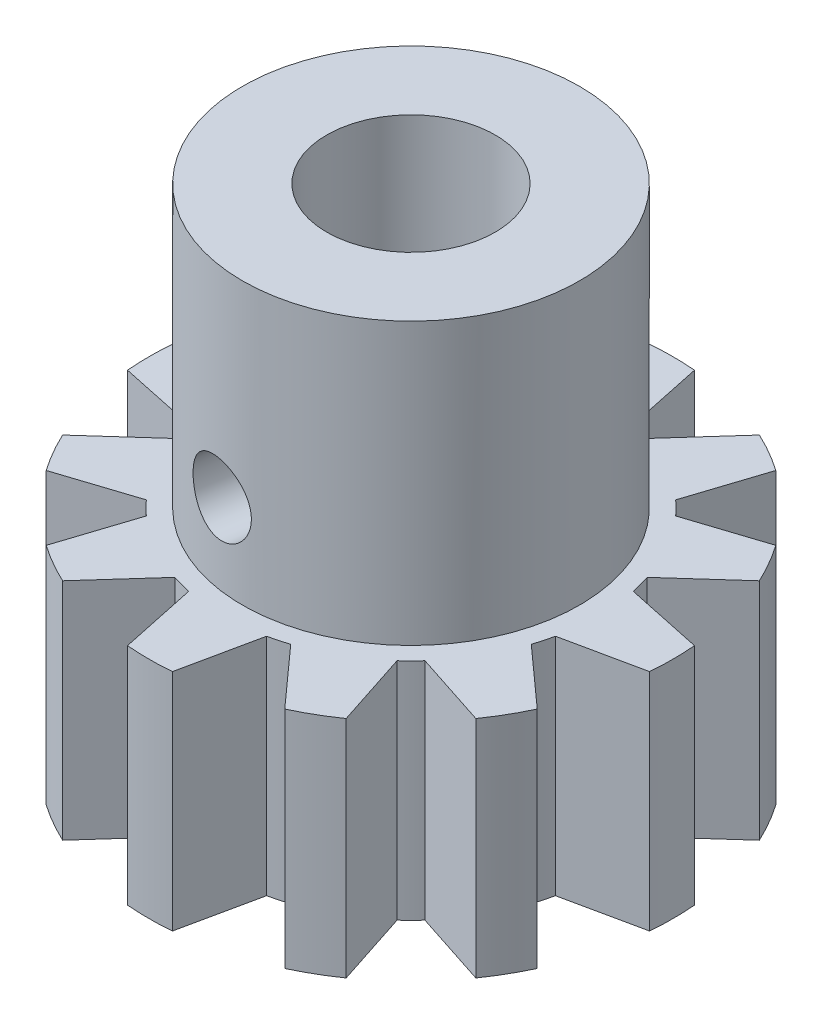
ISO-10303-21;
HEADER;
FILE_DESCRIPTION(('STEP AP214'),'2;1');
FILE_NAME('part.step','',(''),(''),'','','');
FILE_SCHEMA(('AUTOMOTIVE_DESIGN { 1 0 10303 214 1 1 1 1 }'));
ENDSEC;
DATA;
#1=APPLICATION_CONTEXT('core data for automotive mechanical design processes');
#2=APPLICATION_PROTOCOL_DEFINITION('international standard','automotive_design',2000,#1);
#3=PRODUCT_CONTEXT('',#1,'mechanical');
#4=PRODUCT('Part','Part','',(#3));
#5=PRODUCT_RELATED_PRODUCT_CATEGORY('part','',(#4));
#6=PRODUCT_DEFINITION_FORMATION('','',#4);
#7=PRODUCT_DEFINITION_CONTEXT('part definition',#1,'design');
#8=PRODUCT_DEFINITION('design','',#6,#7);
#9=PRODUCT_DEFINITION_SHAPE('','',#8);
#10=(LENGTH_UNIT() NAMED_UNIT(*) SI_UNIT(.MILLI.,.METRE.));
#11=(NAMED_UNIT(*) PLANE_ANGLE_UNIT() SI_UNIT($,.RADIAN.));
#12=(NAMED_UNIT(*) SI_UNIT($,.STERADIAN.) SOLID_ANGLE_UNIT());
#13=UNCERTAINTY_MEASURE_WITH_UNIT(LENGTH_MEASURE(1.E-05),#10,'distance_accuracy_value','');
#14=(GEOMETRIC_REPRESENTATION_CONTEXT(3) GLOBAL_UNCERTAINTY_ASSIGNED_CONTEXT((#13)) GLOBAL_UNIT_ASSIGNED_CONTEXT((#10,
#11,#12)) REPRESENTATION_CONTEXT('',''));
#15=CARTESIAN_POINT('',(0.,0.,0.));
#16=DIRECTION('',(0.,0.,1.));
#17=DIRECTION('',(1.,0.,0.));
#18=AXIS2_PLACEMENT_3D('',#15,#16,#17);
#19=CARTESIAN_POINT('',(0.,6.35,0.));
#20=DIRECTION('',(0.,-1.,0.));
#21=DIRECTION('',(0.,0.,-1.));
#22=AXIS2_PLACEMENT_3D('',#19,#20,#21);
#23=PLANE('',#22);
#24=CARTESIAN_POINT('',(0.,6.35,0.));
#25=DIRECTION('',(0.,1.,0.));
#26=DIRECTION('',(0.,0.,-1.));
#27=AXIS2_PLACEMENT_3D('',#24,#25,#26);
#28=CIRCLE('',#27,7.4041);
#29=CARTESIAN_POINT('',(0.635,6.35,-7.3768198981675));
#30=VERTEX_POINT('',#29);
#31=CARTESIAN_POINT('',(-0.635,6.35,-7.3768198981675));
#32=VERTEX_POINT('',#31);
#33=EDGE_CURVE('E481',#30,#32,#28,.T.);
#34=ORIENTED_EDGE('',*,*,#33,.T.);
#35=DIRECTION('',(-0.207036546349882,0.,0.978333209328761));
#36=VECTOR('',#35,1.);
#37=CARTESIAN_POINT('',(-0.635,6.35,-7.3768198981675));
#38=LINE('',#37,#36);
#39=CARTESIAN_POINT('',(-1.09980093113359,6.35,-5.18044348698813));
#40=VERTEX_POINT('',#39);
#41=EDGE_CURVE('E229',#32,#40,#38,.T.);
#42=ORIENTED_EDGE('',*,*,#41,.T.);
#43=CARTESIAN_POINT('',(0.,6.35,0.));
#44=DIRECTION('',(0.,1.,0.));
#45=DIRECTION('',(0.,0.,-1.));
#46=AXIS2_PLACEMENT_3D('',#43,#44,#45);
#47=CIRCLE('',#46,5.29590000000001);
#48=CARTESIAN_POINT('',(-1.6377661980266,6.35,-5.03629612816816));
#49=VERTEX_POINT('',#48);
#50=EDGE_CURVE('E851',#40,#49,#47,.T.);
#51=ORIENTED_EDGE('',*,*,#50,.T.);
#52=DIRECTION('',(-0.668465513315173,0.,-0.743743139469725));
#53=VECTOR('',#52,1.);
#54=CARTESIAN_POINT('',(-3.13848381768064,6.35,-6.70601343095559));
#55=LINE('',#54,#53);
#56=CARTESIAN_POINT('',(-3.13848381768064,6.35,-6.70601343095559));
#57=VERTEX_POINT('',#56);
#58=EDGE_CURVE('E863',#49,#57,#55,.T.);
#59=ORIENTED_EDGE('',*,*,#58,.T.);
#60=CARTESIAN_POINT('',(0.,6.35,0.));
#61=DIRECTION('',(0.,1.,0.));
#62=DIRECTION('',(0.,0.,-1.));
#63=AXIS2_PLACEMENT_3D('',#60,#61,#62);
#64=CIRCLE('',#63,7.4041);
#65=CARTESIAN_POINT('',(-4.23833608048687,6.35,-6.07101343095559));
#66=VERTEX_POINT('',#65);
#67=EDGE_CURVE('E860',#57,#66,#64,.T.);
#68=ORIENTED_EDGE('',*,*,#67,.T.);
#69=DIRECTION('',(0.309867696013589,0.,0.950779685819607));
#70=VECTOR('',#69,1.);
#71=CARTESIAN_POINT('',(-4.23833608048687,6.35,-6.07101343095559));
#72=LINE('',#71,#70);
#73=CARTESIAN_POINT('',(-3.54267728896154,6.35,-3.93649519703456));
#74=VERTEX_POINT('',#73);
#75=EDGE_CURVE('E862',#66,#74,#72,.T.);
#76=ORIENTED_EDGE('',*,*,#75,.T.);
#77=CARTESIAN_POINT('',(0.,6.35,0.));
#78=DIRECTION('',(0.,1.,0.));
#79=DIRECTION('',(0.,0.,-1.));
#80=AXIS2_PLACEMENT_3D('',#77,#78,#79);
#81=CIRCLE('',#80,5.29590000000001);
#82=CARTESIAN_POINT('',(-3.93649519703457,6.35,-3.54267728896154));
#83=VERTEX_POINT('',#82);
#84=EDGE_CURVE('E865',#74,#83,#81,.T.);
#85=ORIENTED_EDGE('',*,*,#84,.T.);
#86=DIRECTION('',(-0.950779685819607,0.,-0.309867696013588));
#87=VECTOR('',#86,1.);
#88=CARTESIAN_POINT('',(-6.0710134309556,6.35,-4.23833608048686));
#89=LINE('',#88,#87);
#90=CARTESIAN_POINT('',(-6.0710134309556,6.35,-4.23833608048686));
#91=VERTEX_POINT('',#90);
#92=EDGE_CURVE('E871',#83,#91,#89,.T.);
#93=ORIENTED_EDGE('',*,*,#92,.T.);
#94=CARTESIAN_POINT('',(0.,6.35,0.));
#95=DIRECTION('',(0.,1.,0.));
#96=DIRECTION('',(0.,0.,-1.));
#97=AXIS2_PLACEMENT_3D('',#94,#95,#96);
#98=CIRCLE('',#97,7.4041);
#99=CARTESIAN_POINT('',(-6.70601343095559,6.35,-3.13848381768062));
#100=VERTEX_POINT('',#99);
#101=EDGE_CURVE('E873',#91,#100,#98,.T.);
#102=ORIENTED_EDGE('',*,*,#101,.T.);
#103=DIRECTION('',(0.743743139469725,0.,0.668465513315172));
#104=VECTOR('',#103,1.);
#105=CARTESIAN_POINT('',(-6.70601343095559,6.35,-3.13848381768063));
#106=LINE('',#105,#104);
#107=CARTESIAN_POINT('',(-5.03629612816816,6.35,-1.63776619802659));
#108=VERTEX_POINT('',#107);
#109=EDGE_CURVE('E875',#100,#108,#106,.T.);
#110=ORIENTED_EDGE('',*,*,#109,.T.);
#111=CARTESIAN_POINT('',(0.,6.35,0.));
#112=DIRECTION('',(0.,1.,0.));
#113=DIRECTION('',(0.,0.,-1.));
#114=AXIS2_PLACEMENT_3D('',#111,#112,#113);
#115=CIRCLE('',#114,5.29590000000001);
#116=CARTESIAN_POINT('',(-5.18044348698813,6.35,-1.09980093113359));
#117=VERTEX_POINT('',#116);
#118=EDGE_CURVE('E877',#108,#117,#115,.T.);
#119=ORIENTED_EDGE('',*,*,#118,.T.);
#120=DIRECTION('',(-0.978333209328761,0.,0.207036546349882));
#121=VECTOR('',#120,1.);
#122=CARTESIAN_POINT('',(-7.3768198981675,6.35,-0.634999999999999));
#123=LINE('',#122,#121);
#124=CARTESIAN_POINT('',(-7.3768198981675,6.35,-0.634999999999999));
#125=VERTEX_POINT('',#124);
#126=EDGE_CURVE('E879',#117,#125,#123,.T.);
#127=ORIENTED_EDGE('',*,*,#126,.T.);
#128=CARTESIAN_POINT('',(0.,6.35,0.));
#129=DIRECTION('',(0.,1.,0.));
#130=DIRECTION('',(0.,0.,-1.));
#131=AXIS2_PLACEMENT_3D('',#128,#129,#130);
#132=CIRCLE('',#131,7.4041);
#133=CARTESIAN_POINT('',(-7.3768198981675,6.35,0.635000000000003));
#134=VERTEX_POINT('',#133);
#135=EDGE_CURVE('E881',#125,#134,#132,.T.);
#136=ORIENTED_EDGE('',*,*,#135,.T.);
#137=DIRECTION('',(0.978333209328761,0.,0.207036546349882));
#138=VECTOR('',#137,1.);
#139=CARTESIAN_POINT('',(-7.3768198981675,6.35,0.635000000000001));
#140=LINE('',#139,#138);
#141=CARTESIAN_POINT('',(-5.18044348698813,6.35,1.09980093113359));
#142=VERTEX_POINT('',#141);
#143=EDGE_CURVE('E883',#134,#142,#140,.T.);
#144=ORIENTED_EDGE('',*,*,#143,.T.);
#145=CARTESIAN_POINT('',(0.,6.35,0.));
#146=DIRECTION('',(0.,1.,0.));
#147=DIRECTION('',(0.,0.,-1.));
#148=AXIS2_PLACEMENT_3D('',#145,#146,#147);
#149=CIRCLE('',#148,5.29590000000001);
#150=CARTESIAN_POINT('',(-5.03629612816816,6.35,1.6377661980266));
#151=VERTEX_POINT('',#150);
#152=EDGE_CURVE('E885',#142,#151,#149,.T.);
#153=ORIENTED_EDGE('',*,*,#152,.T.);
#154=DIRECTION('',(-0.743743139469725,0.,0.668465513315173));
#155=VECTOR('',#154,1.);
#156=CARTESIAN_POINT('',(-6.70601343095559,6.35,3.13848381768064));
#157=LINE('',#156,#155);
#158=CARTESIAN_POINT('',(-6.70601343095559,6.35,3.13848381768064));
#159=VERTEX_POINT('',#158);
#160=EDGE_CURVE('E887',#151,#159,#157,.T.);
#161=ORIENTED_EDGE('',*,*,#160,.T.);
#162=CARTESIAN_POINT('',(0.,6.35,0.));
#163=DIRECTION('',(0.,1.,0.));
#164=DIRECTION('',(0.,0.,-1.));
#165=AXIS2_PLACEMENT_3D('',#162,#163,#164);
#166=CIRCLE('',#165,7.4041);
#167=CARTESIAN_POINT('',(-6.07101343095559,6.35,4.23833608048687));
#168=VERTEX_POINT('',#167);
#169=EDGE_CURVE('E889',#159,#168,#166,.T.);
#170=ORIENTED_EDGE('',*,*,#169,.T.);
#171=DIRECTION('',(0.950779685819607,0.,-0.309867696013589));
#172=VECTOR('',#171,1.);
#173=CARTESIAN_POINT('',(-6.07101343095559,6.35,4.23833608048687));
#174=LINE('',#173,#172);
#175=CARTESIAN_POINT('',(-3.93649519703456,6.35,3.54267728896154));
#176=VERTEX_POINT('',#175);
#177=EDGE_CURVE('E891',#168,#176,#174,.T.);
#178=ORIENTED_EDGE('',*,*,#177,.T.);
#179=CARTESIAN_POINT('',(0.,6.35,0.));
#180=DIRECTION('',(0.,1.,0.));
#181=DIRECTION('',(0.,0.,-1.));
#182=AXIS2_PLACEMENT_3D('',#179,#180,#181);
#183=CIRCLE('',#182,5.29590000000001);
#184=CARTESIAN_POINT('',(-3.54267728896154,6.35,3.93649519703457));
#185=VERTEX_POINT('',#184);
#186=EDGE_CURVE('E893',#176,#185,#183,.T.);
#187=ORIENTED_EDGE('',*,*,#186,.T.);
#188=DIRECTION('',(-0.309867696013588,0.,0.950779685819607));
#189=VECTOR('',#188,1.);
#190=CARTESIAN_POINT('',(-4.23833608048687,6.35,6.07101343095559));
#191=LINE('',#190,#189);
#192=CARTESIAN_POINT('',(-4.23833608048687,6.35,6.07101343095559));
#193=VERTEX_POINT('',#192);
#194=EDGE_CURVE('E895',#185,#193,#191,.T.);
#195=ORIENTED_EDGE('',*,*,#194,.T.);
#196=CARTESIAN_POINT('',(0.,6.35,0.));
#197=DIRECTION('',(0.,1.,0.));
#198=DIRECTION('',(0.,0.,-1.));
#199=AXIS2_PLACEMENT_3D('',#196,#197,#198);
#200=CIRCLE('',#199,7.4041);
#201=CARTESIAN_POINT('',(-3.13848381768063,6.35,6.70601343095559));
#202=VERTEX_POINT('',#201);
#203=EDGE_CURVE('E897',#193,#202,#200,.T.);
#204=ORIENTED_EDGE('',*,*,#203,.T.);
#205=DIRECTION('',(0.668465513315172,0.,-0.743743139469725));
#206=VECTOR('',#205,1.);
#207=CARTESIAN_POINT('',(-3.13848381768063,6.35,6.70601343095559));
#208=LINE('',#207,#206);
#209=CARTESIAN_POINT('',(-1.63776619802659,6.35,5.03629612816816));
#210=VERTEX_POINT('',#209);
#211=EDGE_CURVE('E899',#202,#210,#208,.T.);
#212=ORIENTED_EDGE('',*,*,#211,.T.);
#213=CARTESIAN_POINT('',(0.,6.35,0.));
#214=DIRECTION('',(0.,1.,0.));
#215=DIRECTION('',(0.,0.,-1.));
#216=AXIS2_PLACEMENT_3D('',#213,#214,#215);
#217=CIRCLE('',#216,5.29590000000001);
#218=CARTESIAN_POINT('',(-1.09980093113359,6.35,5.18044348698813));
#219=VERTEX_POINT('',#218);
#220=EDGE_CURVE('E901',#210,#219,#217,.T.);
#221=ORIENTED_EDGE('',*,*,#220,.T.);
#222=DIRECTION('',(0.207036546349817,0.,0.978333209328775));
#223=VECTOR('',#222,1.);
#224=CARTESIAN_POINT('',(-0.635000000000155,6.35,7.37681989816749));
#225=LINE('',#224,#223);
#226=CARTESIAN_POINT('',(-0.635000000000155,6.35,7.37681989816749));
#227=VERTEX_POINT('',#226);
#228=EDGE_CURVE('E903',#219,#227,#225,.T.);
#229=ORIENTED_EDGE('',*,*,#228,.T.);
#230=CARTESIAN_POINT('',(0.,6.35,0.));
#231=DIRECTION('',(0.,1.,0.));
#232=DIRECTION('',(0.,0.,-1.));
#233=AXIS2_PLACEMENT_3D('',#230,#231,#232);
#234=CIRCLE('',#233,7.4041);
#235=CARTESIAN_POINT('',(0.634999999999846,6.35,7.37681989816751));
#236=VERTEX_POINT('',#235);
#237=EDGE_CURVE('E905',#227,#236,#234,.T.);
#238=ORIENTED_EDGE('',*,*,#237,.T.);
#239=DIRECTION('',(0.207036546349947,0.,-0.978333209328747));
#240=VECTOR('',#239,1.);
#241=CARTESIAN_POINT('',(0.634999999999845,6.35,7.37681989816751));
#242=LINE('',#241,#240);
#243=CARTESIAN_POINT('',(1.09980093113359,6.35,5.18044348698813));
#244=VERTEX_POINT('',#243);
#245=EDGE_CURVE('E907',#236,#244,#242,.T.);
#246=ORIENTED_EDGE('',*,*,#245,.T.);
#247=CARTESIAN_POINT('',(0.,6.35,0.));
#248=DIRECTION('',(0.,1.,0.));
#249=DIRECTION('',(0.,0.,-1.));
#250=AXIS2_PLACEMENT_3D('',#247,#248,#249);
#251=CIRCLE('',#250,5.29590000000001);
#252=CARTESIAN_POINT('',(1.6377661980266,6.35,5.03629612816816));
#253=VERTEX_POINT('',#252);
#254=EDGE_CURVE('E909',#244,#253,#251,.T.);
#255=ORIENTED_EDGE('',*,*,#254,.T.);
#256=DIRECTION('',(0.668465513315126,0.,0.743743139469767));
#257=VECTOR('',#256,1.);
#258=CARTESIAN_POINT('',(3.1384838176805,6.35,6.70601343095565));
#259=LINE('',#258,#257);
#260=CARTESIAN_POINT('',(3.1384838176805,6.35,6.70601343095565));
#261=VERTEX_POINT('',#260);
#262=EDGE_CURVE('E911',#253,#261,#259,.T.);
#263=ORIENTED_EDGE('',*,*,#262,.T.);
#264=CARTESIAN_POINT('',(0.,6.35,0.));
#265=DIRECTION('',(0.,1.,0.));
#266=DIRECTION('',(0.,0.,-1.));
#267=AXIS2_PLACEMENT_3D('',#264,#265,#266);
#268=CIRCLE('',#267,7.4041);
#269=CARTESIAN_POINT('',(4.23833608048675,6.35,6.07101343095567));
#270=VERTEX_POINT('',#269);
#271=EDGE_CURVE('E913',#261,#270,#268,.T.);
#272=ORIENTED_EDGE('',*,*,#271,.T.);
#273=DIRECTION('',(-0.309867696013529,0.,-0.950779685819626));
#274=VECTOR('',#273,1.);
#275=CARTESIAN_POINT('',(4.23833608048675,6.35,6.07101343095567));
#276=LINE('',#275,#274);
#277=CARTESIAN_POINT('',(3.54267728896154,6.35,3.93649519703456));
#278=VERTEX_POINT('',#277);
#279=EDGE_CURVE('E915',#270,#278,#276,.T.);
#280=ORIENTED_EDGE('',*,*,#279,.T.);
#281=CARTESIAN_POINT('',(0.,6.35,0.));
#282=DIRECTION('',(0.,1.,0.));
#283=DIRECTION('',(0.,0.,-1.));
#284=AXIS2_PLACEMENT_3D('',#281,#282,#283);
#285=CIRCLE('',#284,5.29590000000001);
#286=CARTESIAN_POINT('',(3.93649519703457,6.35,3.54267728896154));
#287=VERTEX_POINT('',#286);
#288=EDGE_CURVE('E917',#278,#287,#285,.T.);
#289=ORIENTED_EDGE('',*,*,#288,.T.);
#290=DIRECTION('',(0.950779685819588,0.,0.309867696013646));
#291=VECTOR('',#290,1.);
#292=CARTESIAN_POINT('',(6.07101343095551,6.35,4.23833608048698));
#293=LINE('',#292,#291);
#294=CARTESIAN_POINT('',(6.07101343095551,6.35,4.23833608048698));
#295=VERTEX_POINT('',#294);
#296=EDGE_CURVE('E919',#287,#295,#293,.T.);
#297=ORIENTED_EDGE('',*,*,#296,.T.);
#298=CARTESIAN_POINT('',(0.,6.35,0.));
#299=DIRECTION('',(0.,1.,0.));
#300=DIRECTION('',(0.,0.,-1.));
#301=AXIS2_PLACEMENT_3D('',#298,#299,#300);
#302=CIRCLE('',#301,7.4041);
#303=CARTESIAN_POINT('',(6.70601343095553,6.35,3.13848381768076));
#304=VERTEX_POINT('',#303);
#305=EDGE_CURVE('E921',#295,#304,#302,.T.);
#306=ORIENTED_EDGE('',*,*,#305,.T.);
#307=DIRECTION('',(-0.743743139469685,0.,-0.668465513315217));
#308=VECTOR('',#307,1.);
#309=CARTESIAN_POINT('',(6.70601343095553,6.35,3.13848381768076));
#310=LINE('',#309,#308);
#311=CARTESIAN_POINT('',(5.03629612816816,6.35,1.63776619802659));
#312=VERTEX_POINT('',#311);
#313=EDGE_CURVE('E923',#304,#312,#310,.T.);
#314=ORIENTED_EDGE('',*,*,#313,.T.);
#315=CARTESIAN_POINT('',(0.,6.35,0.));
#316=DIRECTION('',(0.,1.,0.));
#317=DIRECTION('',(0.,0.,-1.));
#318=AXIS2_PLACEMENT_3D('',#315,#316,#317);
#319=CIRCLE('',#318,5.29590000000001);
#320=CARTESIAN_POINT('',(5.18044348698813,6.35,1.09980093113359));
#321=VERTEX_POINT('',#320);
#322=EDGE_CURVE('E925',#312,#321,#319,.T.);
#323=ORIENTED_EDGE('',*,*,#322,.T.);
#324=DIRECTION('',(0.978333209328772,0.,-0.207036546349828));
#325=VECTOR('',#324,1.);
#326=CARTESIAN_POINT('',(7.37681989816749,6.35,0.635000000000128));
#327=LINE('',#326,#325);
#328=CARTESIAN_POINT('',(7.37681989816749,6.35,0.635000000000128));
#329=VERTEX_POINT('',#328);
#330=EDGE_CURVE('E927',#321,#329,#327,.T.);
#331=ORIENTED_EDGE('',*,*,#330,.T.);
#332=CARTESIAN_POINT('',(0.,6.35,0.));
#333=DIRECTION('',(0.,1.,0.));
#334=DIRECTION('',(0.,0.,-1.));
#335=AXIS2_PLACEMENT_3D('',#332,#333,#334);
#336=CIRCLE('',#335,7.4041);
#337=CARTESIAN_POINT('',(7.37681989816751,6.35,-0.634999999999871));
#338=VERTEX_POINT('',#337);
#339=EDGE_CURVE('E929',#329,#338,#336,.T.);
#340=ORIENTED_EDGE('',*,*,#339,.T.);
#341=DIRECTION('',(-0.97833320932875,0.,-0.207036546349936));
#342=VECTOR('',#341,1.);
#343=CARTESIAN_POINT('',(7.37681989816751,6.35,-0.634999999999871));
#344=LINE('',#343,#342);
#345=CARTESIAN_POINT('',(5.18044348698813,6.35,-1.09980093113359));
#346=VERTEX_POINT('',#345);
#347=EDGE_CURVE('E931',#338,#346,#344,.T.);
#348=ORIENTED_EDGE('',*,*,#347,.T.);
#349=CARTESIAN_POINT('',(0.,6.35,0.));
#350=DIRECTION('',(0.,1.,0.));
#351=DIRECTION('',(0.,0.,-1.));
#352=AXIS2_PLACEMENT_3D('',#349,#350,#351);
#353=CIRCLE('',#352,5.29590000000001);
#354=CARTESIAN_POINT('',(5.03629612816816,6.35,-1.63776619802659));
#355=VERTEX_POINT('',#354);
#356=EDGE_CURVE('E933',#346,#355,#353,.T.);
#357=ORIENTED_EDGE('',*,*,#356,.T.);
#358=DIRECTION('',(0.743743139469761,0.,-0.668465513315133));
#359=VECTOR('',#358,1.);
#360=CARTESIAN_POINT('',(6.70601343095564,6.35,-3.13848381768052));
#361=LINE('',#360,#359);
#362=CARTESIAN_POINT('',(6.70601343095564,6.35,-3.13848381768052));
#363=VERTEX_POINT('',#362);
#364=EDGE_CURVE('E935',#355,#363,#361,.T.);
#365=ORIENTED_EDGE('',*,*,#364,.T.);
#366=CARTESIAN_POINT('',(0.,6.35,0.));
#367=DIRECTION('',(0.,1.,0.));
#368=DIRECTION('',(0.,0.,-1.));
#369=AXIS2_PLACEMENT_3D('',#366,#367,#368);
#370=CIRCLE('',#369,7.4041);
#371=CARTESIAN_POINT('',(6.07101343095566,6.35,-4.23833608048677));
#372=VERTEX_POINT('',#371);
#373=EDGE_CURVE('E937',#363,#372,#370,.T.);
#374=ORIENTED_EDGE('',*,*,#373,.T.);
#375=DIRECTION('',(-0.950779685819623,0.,0.309867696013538));
#376=VECTOR('',#375,1.);
#377=CARTESIAN_POINT('',(6.07101343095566,6.35,-4.23833608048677));
#378=LINE('',#377,#376);
#379=CARTESIAN_POINT('',(3.93649519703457,6.35,-3.54267728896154));
#380=VERTEX_POINT('',#379);
#381=EDGE_CURVE('E939',#372,#380,#378,.T.);
#382=ORIENTED_EDGE('',*,*,#381,.T.);
#383=CARTESIAN_POINT('',(0.,6.35,0.));
#384=DIRECTION('',(0.,1.,0.));
#385=DIRECTION('',(0.,0.,-1.));
#386=AXIS2_PLACEMENT_3D('',#383,#384,#385);
#387=CIRCLE('',#386,5.29590000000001);
#388=CARTESIAN_POINT('',(3.54267728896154,6.35,-3.93649519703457));
#389=VERTEX_POINT('',#388);
#390=EDGE_CURVE('E941',#380,#389,#387,.T.);
#391=ORIENTED_EDGE('',*,*,#390,.T.);
#392=DIRECTION('',(0.309867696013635,0.,-0.950779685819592));
#393=VECTOR('',#392,1.);
#394=CARTESIAN_POINT('',(4.23833608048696,6.35,-6.07101343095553));
#395=LINE('',#394,#393);
#396=CARTESIAN_POINT('',(4.23833608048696,6.35,-6.07101343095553));
#397=VERTEX_POINT('',#396);
#398=EDGE_CURVE('E943',#389,#397,#395,.T.);
#399=ORIENTED_EDGE('',*,*,#398,.T.);
#400=CARTESIAN_POINT('',(0.,6.35,0.));
#401=DIRECTION('',(0.,1.,0.));
#402=DIRECTION('',(0.,0.,-1.));
#403=AXIS2_PLACEMENT_3D('',#400,#401,#402);
#404=CIRCLE('',#403,7.4041);
#405=CARTESIAN_POINT('',(3.13848381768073,6.35,-6.70601343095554));
#406=VERTEX_POINT('',#405);
#407=EDGE_CURVE('E368',#397,#406,#404,.T.);
#408=ORIENTED_EDGE('',*,*,#407,.T.);
#409=DIRECTION('',(-0.668465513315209,0.,0.743743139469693));
#410=VECTOR('',#409,1.);
#411=CARTESIAN_POINT('',(3.13848381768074,6.35,-6.70601343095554));
#412=LINE('',#411,#410);
#413=CARTESIAN_POINT('',(1.63776619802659,6.35,-5.03629612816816));
#414=VERTEX_POINT('',#413);
#415=EDGE_CURVE('E362',#406,#414,#412,.T.);
#416=ORIENTED_EDGE('',*,*,#415,.T.);
#417=CARTESIAN_POINT('',(0.,6.35,0.));
#418=DIRECTION('',(0.,1.,0.));
#419=DIRECTION('',(0.,0.,-1.));
#420=AXIS2_PLACEMENT_3D('',#417,#418,#419);
#421=CIRCLE('',#420,5.29590000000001);
#422=CARTESIAN_POINT('',(1.09980093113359,6.35,-5.18044348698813));
#423=VERTEX_POINT('',#422);
#424=EDGE_CURVE('E366',#414,#423,#421,.T.);
#425=ORIENTED_EDGE('',*,*,#424,.T.);
#426=DIRECTION('',(-0.207036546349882,0.,-0.978333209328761));
#427=VECTOR('',#426,1.);
#428=CARTESIAN_POINT('',(0.635,6.35,-7.3768198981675));
#429=LINE('',#428,#427);
#430=EDGE_CURVE('E65',#423,#30,#429,.T.);
#431=ORIENTED_EDGE('',*,*,#430,.T.);
#432=EDGE_LOOP('',(#34,#42,#51,#59,#68,#76,#85,#93,#102,#110,#119,#127,#136,#144,#153,#161,#170,
#178,#187,#195,#204,#212,#221,#229,#238,#246,#255,#263,#272,#280,#289,#297,#306,#314,#323,#331,
#340,#348,#357,#365,#374,#382,#391,#399,#408,#416,#425,#431));
#433=FACE_BOUND('',#432,.T.);
#434=CARTESIAN_POINT('',(0.,6.35,0.));
#435=DIRECTION('',(0.,-1.,0.));
#436=DIRECTION('',(0.,0.,-1.));
#437=AXIS2_PLACEMENT_3D('',#434,#435,#436);
#438=CIRCLE('',#437,4.7625);
#439=CARTESIAN_POINT('',(0.,6.35,-4.7625));
#440=VERTEX_POINT('',#439);
#441=EDGE_CURVE('E11',#440,#440,#438,.F.);
#442=ORIENTED_EDGE('',*,*,#441,.F.);
#443=EDGE_LOOP('',(#442));
#444=FACE_BOUND('',#443,.T.);
#445=ADVANCED_FACE('F41',(#433,#444),#23,.F.);
#446=CARTESIAN_POINT('',(0.,0.,0.));
#447=DIRECTION('',(0.,-1.,0.));
#448=DIRECTION('',(0.,0.,-1.));
#449=AXIS2_PLACEMENT_3D('',#446,#447,#448);
#450=PLANE('',#449);
#451=CARTESIAN_POINT('',(0.,0.,0.));
#452=DIRECTION('',(0.,1.,0.));
#453=DIRECTION('',(0.,0.,-1.));
#454=AXIS2_PLACEMENT_3D('',#451,#452,#453);
#455=CIRCLE('',#454,7.4041);
#456=CARTESIAN_POINT('',(0.635,0.,-7.3768198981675));
#457=VERTEX_POINT('',#456);
#458=CARTESIAN_POINT('',(-0.635,0.,-7.3768198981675));
#459=VERTEX_POINT('',#458);
#460=EDGE_CURVE('E386',#457,#459,#455,.T.);
#461=ORIENTED_EDGE('',*,*,#460,.F.);
#462=DIRECTION('',(-0.207036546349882,0.,-0.978333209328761));
#463=VECTOR('',#462,1.);
#464=CARTESIAN_POINT('',(0.635,0.,-7.3768198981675));
#465=LINE('',#464,#463);
#466=CARTESIAN_POINT('',(1.09980093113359,0.,-5.18044348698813));
#467=VERTEX_POINT('',#466);
#468=EDGE_CURVE('E220',#467,#457,#465,.T.);
#469=ORIENTED_EDGE('',*,*,#468,.F.);
#470=CARTESIAN_POINT('',(0.,0.,0.));
#471=DIRECTION('',(0.,1.,0.));
#472=DIRECTION('',(0.,0.,-1.));
#473=AXIS2_PLACEMENT_3D('',#470,#471,#472);
#474=CIRCLE('',#473,5.29590000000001);
#475=CARTESIAN_POINT('',(1.63776619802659,0.,-5.03629612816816));
#476=VERTEX_POINT('',#475);
#477=EDGE_CURVE('E214',#476,#467,#474,.T.);
#478=ORIENTED_EDGE('',*,*,#477,.F.);
#479=DIRECTION('',(-0.668465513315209,0.,0.743743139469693));
#480=VECTOR('',#479,1.);
#481=CARTESIAN_POINT('',(3.13848381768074,0.,-6.70601343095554));
#482=LINE('',#481,#480);
#483=CARTESIAN_POINT('',(3.13848381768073,0.,-6.70601343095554));
#484=VERTEX_POINT('',#483);
#485=EDGE_CURVE('E376',#484,#476,#482,.T.);
#486=ORIENTED_EDGE('',*,*,#485,.F.);
#487=CARTESIAN_POINT('',(0.,0.,0.));
#488=DIRECTION('',(0.,1.,0.));
#489=DIRECTION('',(0.,0.,-1.));
#490=AXIS2_PLACEMENT_3D('',#487,#488,#489);
#491=CIRCLE('',#490,7.4041);
#492=CARTESIAN_POINT('',(4.23833608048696,0.,-6.07101343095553));
#493=VERTEX_POINT('',#492);
#494=EDGE_CURVE('E476',#493,#484,#491,.T.);
#495=ORIENTED_EDGE('',*,*,#494,.F.);
#496=DIRECTION('',(0.309867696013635,0.,-0.950779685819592));
#497=VECTOR('',#496,1.);
#498=CARTESIAN_POINT('',(4.23833608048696,0.,-6.07101343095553));
#499=LINE('',#498,#497);
#500=CARTESIAN_POINT('',(3.54267728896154,0.,-3.93649519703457));
#501=VERTEX_POINT('',#500);
#502=EDGE_CURVE('E474',#501,#493,#499,.T.);
#503=ORIENTED_EDGE('',*,*,#502,.F.);
#504=CARTESIAN_POINT('',(0.,0.,0.));
#505=DIRECTION('',(0.,1.,0.));
#506=DIRECTION('',(0.,0.,-1.));
#507=AXIS2_PLACEMENT_3D('',#504,#505,#506);
#508=CIRCLE('',#507,5.29590000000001);
#509=CARTESIAN_POINT('',(3.93649519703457,0.,-3.54267728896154));
#510=VERTEX_POINT('',#509);
#511=EDGE_CURVE('E472',#510,#501,#508,.T.);
#512=ORIENTED_EDGE('',*,*,#511,.F.);
#513=DIRECTION('',(-0.950779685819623,0.,0.309867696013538));
#514=VECTOR('',#513,1.);
#515=CARTESIAN_POINT('',(6.07101343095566,0.,-4.23833608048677));
#516=LINE('',#515,#514);
#517=CARTESIAN_POINT('',(6.07101343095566,0.,-4.23833608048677));
#518=VERTEX_POINT('',#517);
#519=EDGE_CURVE('E470',#518,#510,#516,.T.);
#520=ORIENTED_EDGE('',*,*,#519,.F.);
#521=CARTESIAN_POINT('',(0.,0.,0.));
#522=DIRECTION('',(0.,1.,0.));
#523=DIRECTION('',(0.,0.,-1.));
#524=AXIS2_PLACEMENT_3D('',#521,#522,#523);
#525=CIRCLE('',#524,7.4041);
#526=CARTESIAN_POINT('',(6.70601343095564,0.,-3.13848381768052));
#527=VERTEX_POINT('',#526);
#528=EDGE_CURVE('E468',#527,#518,#525,.T.);
#529=ORIENTED_EDGE('',*,*,#528,.F.);
#530=DIRECTION('',(0.743743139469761,0.,-0.668465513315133));
#531=VECTOR('',#530,1.);
#532=CARTESIAN_POINT('',(6.70601343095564,0.,-3.13848381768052));
#533=LINE('',#532,#531);
#534=CARTESIAN_POINT('',(5.03629612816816,0.,-1.63776619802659));
#535=VERTEX_POINT('',#534);
#536=EDGE_CURVE('E466',#535,#527,#533,.T.);
#537=ORIENTED_EDGE('',*,*,#536,.F.);
#538=CARTESIAN_POINT('',(0.,0.,0.));
#539=DIRECTION('',(0.,1.,0.));
#540=DIRECTION('',(0.,0.,-1.));
#541=AXIS2_PLACEMENT_3D('',#538,#539,#540);
#542=CIRCLE('',#541,5.29590000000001);
#543=CARTESIAN_POINT('',(5.18044348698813,0.,-1.09980093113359));
#544=VERTEX_POINT('',#543);
#545=EDGE_CURVE('E464',#544,#535,#542,.T.);
#546=ORIENTED_EDGE('',*,*,#545,.F.);
#547=DIRECTION('',(-0.97833320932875,0.,-0.207036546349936));
#548=VECTOR('',#547,1.);
#549=CARTESIAN_POINT('',(7.37681989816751,0.,-0.634999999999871));
#550=LINE('',#549,#548);
#551=CARTESIAN_POINT('',(7.37681989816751,0.,-0.634999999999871));
#552=VERTEX_POINT('',#551);
#553=EDGE_CURVE('E462',#552,#544,#550,.T.);
#554=ORIENTED_EDGE('',*,*,#553,.F.);
#555=CARTESIAN_POINT('',(0.,0.,0.));
#556=DIRECTION('',(0.,1.,0.));
#557=DIRECTION('',(0.,0.,-1.));
#558=AXIS2_PLACEMENT_3D('',#555,#556,#557);
#559=CIRCLE('',#558,7.4041);
#560=CARTESIAN_POINT('',(7.37681989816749,0.,0.635000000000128));
#561=VERTEX_POINT('',#560);
#562=EDGE_CURVE('E460',#561,#552,#559,.T.);
#563=ORIENTED_EDGE('',*,*,#562,.F.);
#564=DIRECTION('',(0.978333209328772,0.,-0.207036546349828));
#565=VECTOR('',#564,1.);
#566=CARTESIAN_POINT('',(7.37681989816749,0.,0.635000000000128));
#567=LINE('',#566,#565);
#568=CARTESIAN_POINT('',(5.18044348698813,0.,1.09980093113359));
#569=VERTEX_POINT('',#568);
#570=EDGE_CURVE('E458',#569,#561,#567,.T.);
#571=ORIENTED_EDGE('',*,*,#570,.F.);
#572=CARTESIAN_POINT('',(0.,0.,0.));
#573=DIRECTION('',(0.,1.,0.));
#574=DIRECTION('',(0.,0.,-1.));
#575=AXIS2_PLACEMENT_3D('',#572,#573,#574);
#576=CIRCLE('',#575,5.29590000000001);
#577=CARTESIAN_POINT('',(5.03629612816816,0.,1.63776619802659));
#578=VERTEX_POINT('',#577);
#579=EDGE_CURVE('E456',#578,#569,#576,.T.);
#580=ORIENTED_EDGE('',*,*,#579,.F.);
#581=DIRECTION('',(-0.743743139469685,0.,-0.668465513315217));
#582=VECTOR('',#581,1.);
#583=CARTESIAN_POINT('',(6.70601343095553,0.,3.13848381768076));
#584=LINE('',#583,#582);
#585=CARTESIAN_POINT('',(6.70601343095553,0.,3.13848381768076));
#586=VERTEX_POINT('',#585);
#587=EDGE_CURVE('E454',#586,#578,#584,.T.);
#588=ORIENTED_EDGE('',*,*,#587,.F.);
#589=CARTESIAN_POINT('',(0.,0.,0.));
#590=DIRECTION('',(0.,1.,0.));
#591=DIRECTION('',(0.,0.,-1.));
#592=AXIS2_PLACEMENT_3D('',#589,#590,#591);
#593=CIRCLE('',#592,7.4041);
#594=CARTESIAN_POINT('',(6.07101343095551,0.,4.23833608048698));
#595=VERTEX_POINT('',#594);
#596=EDGE_CURVE('E452',#595,#586,#593,.T.);
#597=ORIENTED_EDGE('',*,*,#596,.F.);
#598=DIRECTION('',(0.950779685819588,0.,0.309867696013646));
#599=VECTOR('',#598,1.);
#600=CARTESIAN_POINT('',(6.07101343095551,0.,4.23833608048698));
#601=LINE('',#600,#599);
#602=CARTESIAN_POINT('',(3.93649519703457,0.,3.54267728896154));
#603=VERTEX_POINT('',#602);
#604=EDGE_CURVE('E450',#603,#595,#601,.T.);
#605=ORIENTED_EDGE('',*,*,#604,.F.);
#606=CARTESIAN_POINT('',(0.,0.,0.));
#607=DIRECTION('',(0.,1.,0.));
#608=DIRECTION('',(0.,0.,-1.));
#609=AXIS2_PLACEMENT_3D('',#606,#607,#608);
#610=CIRCLE('',#609,5.29590000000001);
#611=CARTESIAN_POINT('',(3.54267728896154,0.,3.93649519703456));
#612=VERTEX_POINT('',#611);
#613=EDGE_CURVE('E448',#612,#603,#610,.T.);
#614=ORIENTED_EDGE('',*,*,#613,.F.);
#615=DIRECTION('',(-0.309867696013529,0.,-0.950779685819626));
#616=VECTOR('',#615,1.);
#617=CARTESIAN_POINT('',(4.23833608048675,0.,6.07101343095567));
#618=LINE('',#617,#616);
#619=CARTESIAN_POINT('',(4.23833608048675,0.,6.07101343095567));
#620=VERTEX_POINT('',#619);
#621=EDGE_CURVE('E446',#620,#612,#618,.T.);
#622=ORIENTED_EDGE('',*,*,#621,.F.);
#623=CARTESIAN_POINT('',(0.,0.,0.));
#624=DIRECTION('',(0.,1.,0.));
#625=DIRECTION('',(0.,0.,-1.));
#626=AXIS2_PLACEMENT_3D('',#623,#624,#625);
#627=CIRCLE('',#626,7.4041);
#628=CARTESIAN_POINT('',(3.1384838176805,0.,6.70601343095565));
#629=VERTEX_POINT('',#628);
#630=EDGE_CURVE('E444',#629,#620,#627,.T.);
#631=ORIENTED_EDGE('',*,*,#630,.F.);
#632=DIRECTION('',(0.668465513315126,0.,0.743743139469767));
#633=VECTOR('',#632,1.);
#634=CARTESIAN_POINT('',(3.1384838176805,0.,6.70601343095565));
#635=LINE('',#634,#633);
#636=CARTESIAN_POINT('',(1.6377661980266,0.,5.03629612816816));
#637=VERTEX_POINT('',#636);
#638=EDGE_CURVE('E442',#637,#629,#635,.T.);
#639=ORIENTED_EDGE('',*,*,#638,.F.);
#640=CARTESIAN_POINT('',(0.,0.,0.));
#641=DIRECTION('',(0.,1.,0.));
#642=DIRECTION('',(0.,0.,-1.));
#643=AXIS2_PLACEMENT_3D('',#640,#641,#642);
#644=CIRCLE('',#643,5.29590000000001);
#645=CARTESIAN_POINT('',(1.09980093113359,0.,5.18044348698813));
#646=VERTEX_POINT('',#645);
#647=EDGE_CURVE('E440',#646,#637,#644,.T.);
#648=ORIENTED_EDGE('',*,*,#647,.F.);
#649=DIRECTION('',(0.207036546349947,0.,-0.978333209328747));
#650=VECTOR('',#649,1.);
#651=CARTESIAN_POINT('',(0.634999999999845,0.,7.37681989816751));
#652=LINE('',#651,#650);
#653=CARTESIAN_POINT('',(0.634999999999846,0.,7.37681989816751));
#654=VERTEX_POINT('',#653);
#655=EDGE_CURVE('E438',#654,#646,#652,.T.);
#656=ORIENTED_EDGE('',*,*,#655,.F.);
#657=CARTESIAN_POINT('',(0.,0.,0.));
#658=DIRECTION('',(0.,1.,0.));
#659=DIRECTION('',(0.,0.,-1.));
#660=AXIS2_PLACEMENT_3D('',#657,#658,#659);
#661=CIRCLE('',#660,7.4041);
#662=CARTESIAN_POINT('',(-0.635000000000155,0.,7.37681989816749));
#663=VERTEX_POINT('',#662);
#664=EDGE_CURVE('E436',#663,#654,#661,.T.);
#665=ORIENTED_EDGE('',*,*,#664,.F.);
#666=DIRECTION('',(0.207036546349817,0.,0.978333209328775));
#667=VECTOR('',#666,1.);
#668=CARTESIAN_POINT('',(-0.635000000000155,0.,7.37681989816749));
#669=LINE('',#668,#667);
#670=CARTESIAN_POINT('',(-1.09980093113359,0.,5.18044348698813));
#671=VERTEX_POINT('',#670);
#672=EDGE_CURVE('E434',#671,#663,#669,.T.);
#673=ORIENTED_EDGE('',*,*,#672,.F.);
#674=CARTESIAN_POINT('',(0.,0.,0.));
#675=DIRECTION('',(0.,1.,0.));
#676=DIRECTION('',(0.,0.,-1.));
#677=AXIS2_PLACEMENT_3D('',#674,#675,#676);
#678=CIRCLE('',#677,5.29590000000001);
#679=CARTESIAN_POINT('',(-1.63776619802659,0.,5.03629612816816));
#680=VERTEX_POINT('',#679);
#681=EDGE_CURVE('E432',#680,#671,#678,.T.);
#682=ORIENTED_EDGE('',*,*,#681,.F.);
#683=DIRECTION('',(0.668465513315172,0.,-0.743743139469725));
#684=VECTOR('',#683,1.);
#685=CARTESIAN_POINT('',(-3.13848381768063,0.,6.70601343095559));
#686=LINE('',#685,#684);
#687=CARTESIAN_POINT('',(-3.13848381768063,0.,6.70601343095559));
#688=VERTEX_POINT('',#687);
#689=EDGE_CURVE('E430',#688,#680,#686,.T.);
#690=ORIENTED_EDGE('',*,*,#689,.F.);
#691=CARTESIAN_POINT('',(0.,0.,0.));
#692=DIRECTION('',(0.,1.,0.));
#693=DIRECTION('',(0.,0.,-1.));
#694=AXIS2_PLACEMENT_3D('',#691,#692,#693);
#695=CIRCLE('',#694,7.4041);
#696=CARTESIAN_POINT('',(-4.23833608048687,0.,6.07101343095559));
#697=VERTEX_POINT('',#696);
#698=EDGE_CURVE('E428',#697,#688,#695,.T.);
#699=ORIENTED_EDGE('',*,*,#698,.F.);
#700=DIRECTION('',(-0.309867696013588,0.,0.950779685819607));
#701=VECTOR('',#700,1.);
#702=CARTESIAN_POINT('',(-4.23833608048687,0.,6.07101343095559));
#703=LINE('',#702,#701);
#704=CARTESIAN_POINT('',(-3.54267728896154,0.,3.93649519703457));
#705=VERTEX_POINT('',#704);
#706=EDGE_CURVE('E426',#705,#697,#703,.T.);
#707=ORIENTED_EDGE('',*,*,#706,.F.);
#708=CARTESIAN_POINT('',(0.,0.,0.));
#709=DIRECTION('',(0.,1.,0.));
#710=DIRECTION('',(0.,0.,-1.));
#711=AXIS2_PLACEMENT_3D('',#708,#709,#710);
#712=CIRCLE('',#711,5.29590000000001);
#713=CARTESIAN_POINT('',(-3.93649519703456,0.,3.54267728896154));
#714=VERTEX_POINT('',#713);
#715=EDGE_CURVE('E424',#714,#705,#712,.T.);
#716=ORIENTED_EDGE('',*,*,#715,.F.);
#717=DIRECTION('',(0.950779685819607,0.,-0.309867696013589));
#718=VECTOR('',#717,1.);
#719=CARTESIAN_POINT('',(-6.07101343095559,0.,4.23833608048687));
#720=LINE('',#719,#718);
#721=CARTESIAN_POINT('',(-6.07101343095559,0.,4.23833608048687));
#722=VERTEX_POINT('',#721);
#723=EDGE_CURVE('E422',#722,#714,#720,.T.);
#724=ORIENTED_EDGE('',*,*,#723,.F.);
#725=CARTESIAN_POINT('',(0.,0.,0.));
#726=DIRECTION('',(0.,1.,0.));
#727=DIRECTION('',(0.,0.,-1.));
#728=AXIS2_PLACEMENT_3D('',#725,#726,#727);
#729=CIRCLE('',#728,7.4041);
#730=CARTESIAN_POINT('',(-6.70601343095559,0.,3.13848381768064));
#731=VERTEX_POINT('',#730);
#732=EDGE_CURVE('E420',#731,#722,#729,.T.);
#733=ORIENTED_EDGE('',*,*,#732,.F.);
#734=DIRECTION('',(-0.743743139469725,0.,0.668465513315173));
#735=VECTOR('',#734,1.);
#736=CARTESIAN_POINT('',(-6.70601343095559,0.,3.13848381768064));
#737=LINE('',#736,#735);
#738=CARTESIAN_POINT('',(-5.03629612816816,0.,1.6377661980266));
#739=VERTEX_POINT('',#738);
#740=EDGE_CURVE('E418',#739,#731,#737,.T.);
#741=ORIENTED_EDGE('',*,*,#740,.F.);
#742=CARTESIAN_POINT('',(0.,0.,0.));
#743=DIRECTION('',(0.,1.,0.));
#744=DIRECTION('',(0.,0.,-1.));
#745=AXIS2_PLACEMENT_3D('',#742,#743,#744);
#746=CIRCLE('',#745,5.29590000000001);
#747=CARTESIAN_POINT('',(-5.18044348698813,0.,1.09980093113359));
#748=VERTEX_POINT('',#747);
#749=EDGE_CURVE('E416',#748,#739,#746,.T.);
#750=ORIENTED_EDGE('',*,*,#749,.F.);
#751=DIRECTION('',(0.978333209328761,0.,0.207036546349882));
#752=VECTOR('',#751,1.);
#753=CARTESIAN_POINT('',(-7.3768198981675,0.,0.635000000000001));
#754=LINE('',#753,#752);
#755=CARTESIAN_POINT('',(-7.3768198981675,0.,0.635000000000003));
#756=VERTEX_POINT('',#755);
#757=EDGE_CURVE('E414',#756,#748,#754,.T.);
#758=ORIENTED_EDGE('',*,*,#757,.F.);
#759=CARTESIAN_POINT('',(0.,0.,0.));
#760=DIRECTION('',(0.,1.,0.));
#761=DIRECTION('',(0.,0.,-1.));
#762=AXIS2_PLACEMENT_3D('',#759,#760,#761);
#763=CIRCLE('',#762,7.4041);
#764=CARTESIAN_POINT('',(-7.3768198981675,0.,-0.634999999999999));
#765=VERTEX_POINT('',#764);
#766=EDGE_CURVE('E412',#765,#756,#763,.T.);
#767=ORIENTED_EDGE('',*,*,#766,.F.);
#768=DIRECTION('',(-0.978333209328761,0.,0.207036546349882));
#769=VECTOR('',#768,1.);
#770=CARTESIAN_POINT('',(-7.3768198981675,0.,-0.634999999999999));
#771=LINE('',#770,#769);
#772=CARTESIAN_POINT('',(-5.18044348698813,0.,-1.09980093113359));
#773=VERTEX_POINT('',#772);
#774=EDGE_CURVE('E410',#773,#765,#771,.T.);
#775=ORIENTED_EDGE('',*,*,#774,.F.);
#776=CARTESIAN_POINT('',(0.,0.,0.));
#777=DIRECTION('',(0.,1.,0.));
#778=DIRECTION('',(0.,0.,-1.));
#779=AXIS2_PLACEMENT_3D('',#776,#777,#778);
#780=CIRCLE('',#779,5.29590000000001);
#781=CARTESIAN_POINT('',(-5.03629612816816,0.,-1.63776619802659));
#782=VERTEX_POINT('',#781);
#783=EDGE_CURVE('E408',#782,#773,#780,.T.);
#784=ORIENTED_EDGE('',*,*,#783,.F.);
#785=DIRECTION('',(0.743743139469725,0.,0.668465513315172));
#786=VECTOR('',#785,1.);
#787=CARTESIAN_POINT('',(-6.70601343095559,0.,-3.13848381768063));
#788=LINE('',#787,#786);
#789=CARTESIAN_POINT('',(-6.70601343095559,0.,-3.13848381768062));
#790=VERTEX_POINT('',#789);
#791=EDGE_CURVE('E406',#790,#782,#788,.T.);
#792=ORIENTED_EDGE('',*,*,#791,.F.);
#793=CARTESIAN_POINT('',(0.,0.,0.));
#794=DIRECTION('',(0.,1.,0.));
#795=DIRECTION('',(0.,0.,-1.));
#796=AXIS2_PLACEMENT_3D('',#793,#794,#795);
#797=CIRCLE('',#796,7.4041);
#798=CARTESIAN_POINT('',(-6.0710134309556,0.,-4.23833608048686));
#799=VERTEX_POINT('',#798);
#800=EDGE_CURVE('E404',#799,#790,#797,.T.);
#801=ORIENTED_EDGE('',*,*,#800,.F.);
#802=DIRECTION('',(-0.950779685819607,0.,-0.309867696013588));
#803=VECTOR('',#802,1.);
#804=CARTESIAN_POINT('',(-6.0710134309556,0.,-4.23833608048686));
#805=LINE('',#804,#803);
#806=CARTESIAN_POINT('',(-3.93649519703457,0.,-3.54267728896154));
#807=VERTEX_POINT('',#806);
#808=EDGE_CURVE('E402',#807,#799,#805,.T.);
#809=ORIENTED_EDGE('',*,*,#808,.F.);
#810=CARTESIAN_POINT('',(0.,0.,0.));
#811=DIRECTION('',(0.,1.,0.));
#812=DIRECTION('',(0.,0.,-1.));
#813=AXIS2_PLACEMENT_3D('',#810,#811,#812);
#814=CIRCLE('',#813,5.29590000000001);
#815=CARTESIAN_POINT('',(-3.54267728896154,0.,-3.93649519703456));
#816=VERTEX_POINT('',#815);
#817=EDGE_CURVE('E400',#816,#807,#814,.T.);
#818=ORIENTED_EDGE('',*,*,#817,.F.);
#819=DIRECTION('',(0.309867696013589,0.,0.950779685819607));
#820=VECTOR('',#819,1.);
#821=CARTESIAN_POINT('',(-4.23833608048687,0.,-6.07101343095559));
#822=LINE('',#821,#820);
#823=CARTESIAN_POINT('',(-4.23833608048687,0.,-6.07101343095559));
#824=VERTEX_POINT('',#823);
#825=EDGE_CURVE('E398',#824,#816,#822,.T.);
#826=ORIENTED_EDGE('',*,*,#825,.F.);
#827=CARTESIAN_POINT('',(0.,0.,0.));
#828=DIRECTION('',(0.,1.,0.));
#829=DIRECTION('',(0.,0.,-1.));
#830=AXIS2_PLACEMENT_3D('',#827,#828,#829);
#831=CIRCLE('',#830,7.4041);
#832=CARTESIAN_POINT('',(-3.13848381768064,0.,-6.70601343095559));
#833=VERTEX_POINT('',#832);
#834=EDGE_CURVE('E396',#833,#824,#831,.T.);
#835=ORIENTED_EDGE('',*,*,#834,.F.);
#836=DIRECTION('',(-0.668465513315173,0.,-0.743743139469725));
#837=VECTOR('',#836,1.);
#838=CARTESIAN_POINT('',(-3.13848381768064,0.,-6.70601343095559));
#839=LINE('',#838,#837);
#840=CARTESIAN_POINT('',(-1.6377661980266,0.,-5.03629612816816));
#841=VERTEX_POINT('',#840);
#842=EDGE_CURVE('E394',#841,#833,#839,.T.);
#843=ORIENTED_EDGE('',*,*,#842,.F.);
#844=CARTESIAN_POINT('',(0.,0.,0.));
#845=DIRECTION('',(0.,1.,0.));
#846=DIRECTION('',(0.,0.,-1.));
#847=AXIS2_PLACEMENT_3D('',#844,#845,#846);
#848=CIRCLE('',#847,5.29590000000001);
#849=CARTESIAN_POINT('',(-1.09980093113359,0.,-5.18044348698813));
#850=VERTEX_POINT('',#849);
#851=EDGE_CURVE('E392',#850,#841,#848,.T.);
#852=ORIENTED_EDGE('',*,*,#851,.F.);
#853=DIRECTION('',(-0.207036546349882,0.,0.978333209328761));
#854=VECTOR('',#853,1.);
#855=CARTESIAN_POINT('',(-0.635,0.,-7.3768198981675));
#856=LINE('',#855,#854);
#857=EDGE_CURVE('E389',#459,#850,#856,.T.);
#858=ORIENTED_EDGE('',*,*,#857,.F.);
#859=EDGE_LOOP('',(#461,#469,#478,#486,#495,#503,#512,#520,#529,#537,#546,#554,#563,#571,#580,
#588,#597,#605,#614,#622,#631,#639,#648,#656,#665,#673,#682,#690,#699,#707,#716,#724,#733,#741,
#750,#758,#767,#775,#784,#792,#801,#809,#818,#826,#835,#843,#852,#858));
#860=FACE_BOUND('',#859,.T.);
#861=CARTESIAN_POINT('',(0.,0.,0.));
#862=DIRECTION('',(0.,1.,0.));
#863=DIRECTION('',(0.,0.,1.));
#864=AXIS2_PLACEMENT_3D('',#861,#862,#863);
#865=CIRCLE('',#864,2.38125);
#866=CARTESIAN_POINT('',(0.,0.,2.38125));
#867=VERTEX_POINT('',#866);
#868=EDGE_CURVE('E390',#867,#867,#865,.T.);
#869=ORIENTED_EDGE('',*,*,#868,.T.);
#870=EDGE_LOOP('',(#869));
#871=FACE_BOUND('',#870,.T.);
#872=ADVANCED_FACE('F659',(#860,#871),#450,.T.);
#873=CARTESIAN_POINT('',(0.,6.35,0.));
#874=DIRECTION('',(0.,-1.,0.));
#875=DIRECTION('',(0.,0.,-1.));
#876=AXIS2_PLACEMENT_3D('',#873,#874,#875);
#877=CYLINDRICAL_SURFACE('',#876,7.4041);
#878=ORIENTED_EDGE('',*,*,#460,.T.);
#879=DIRECTION('',(0.,-1.,0.));
#880=VECTOR('',#879,1.);
#881=CARTESIAN_POINT('',(-0.635,6.35,-7.3768198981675));
#882=LINE('',#881,#880);
#883=EDGE_CURVE('E56',#32,#459,#882,.T.);
#884=ORIENTED_EDGE('',*,*,#883,.F.);
#885=ORIENTED_EDGE('',*,*,#33,.F.);
#886=DIRECTION('',(0.,-1.,0.));
#887=VECTOR('',#886,1.);
#888=CARTESIAN_POINT('',(0.635,6.35,-7.3768198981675));
#889=LINE('',#888,#887);
#890=EDGE_CURVE('E382',#30,#457,#889,.T.);
#891=ORIENTED_EDGE('',*,*,#890,.T.);
#892=EDGE_LOOP('',(#878,#884,#885,#891));
#893=FACE_BOUND('',#892,.T.);
#894=ADVANCED_FACE('F43',(#893),#877,.T.);
#895=CARTESIAN_POINT('',(-0.635,6.35,-7.3768198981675));
#896=DIRECTION('',(0.978333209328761,0.,0.207036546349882));
#897=DIRECTION('',(0.207036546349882,0.,-0.978333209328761));
#898=AXIS2_PLACEMENT_3D('',#895,#896,#897);
#899=PLANE('',#898);
#900=ORIENTED_EDGE('',*,*,#857,.T.);
#901=DIRECTION('',(0.,-1.,0.));
#902=VECTOR('',#901,1.);
#903=CARTESIAN_POINT('',(-1.09980093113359,6.35,-5.18044348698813));
#904=LINE('',#903,#902);
#905=EDGE_CURVE('E611',#40,#850,#904,.T.);
#906=ORIENTED_EDGE('',*,*,#905,.F.);
#907=ORIENTED_EDGE('',*,*,#41,.F.);
#908=ORIENTED_EDGE('',*,*,#883,.T.);
#909=EDGE_LOOP('',(#900,#906,#907,#908));
#910=FACE_BOUND('',#909,.T.);
#911=ADVANCED_FACE('F839',(#910),#899,.F.);
#912=CARTESIAN_POINT('',(0.,6.35,0.));
#913=DIRECTION('',(0.,-1.,0.));
#914=DIRECTION('',(0.,0.,-1.));
#915=AXIS2_PLACEMENT_3D('',#912,#913,#914);
#916=CYLINDRICAL_SURFACE('',#915,5.29590000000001);
#917=ORIENTED_EDGE('',*,*,#851,.T.);
#918=DIRECTION('',(0.,-1.,0.));
#919=VECTOR('',#918,1.);
#920=CARTESIAN_POINT('',(-1.6377661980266,6.35,-5.03629612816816));
#921=LINE('',#920,#919);
#922=EDGE_CURVE('E608',#49,#841,#921,.T.);
#923=ORIENTED_EDGE('',*,*,#922,.F.);
#924=ORIENTED_EDGE('',*,*,#50,.F.);
#925=ORIENTED_EDGE('',*,*,#905,.T.);
#926=EDGE_LOOP('',(#917,#923,#924,#925));
#927=FACE_BOUND('',#926,.T.);
#928=ADVANCED_FACE('F836',(#927),#916,.T.);
#929=CARTESIAN_POINT('',(-3.13848381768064,6.35,-6.70601343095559));
#930=DIRECTION('',(-0.743743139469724,0.,0.668465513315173));
#931=DIRECTION('',(0.668465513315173,0.,0.743743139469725));
#932=AXIS2_PLACEMENT_3D('',#929,#930,#931);
#933=PLANE('',#932);
#934=ORIENTED_EDGE('',*,*,#842,.T.);
#935=DIRECTION('',(0.,-1.,0.));
#936=VECTOR('',#935,1.);
#937=CARTESIAN_POINT('',(-3.13848381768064,6.35,-6.70601343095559));
#938=LINE('',#937,#936);
#939=EDGE_CURVE('E605',#57,#833,#938,.T.);
#940=ORIENTED_EDGE('',*,*,#939,.F.);
#941=ORIENTED_EDGE('',*,*,#58,.F.);
#942=ORIENTED_EDGE('',*,*,#922,.T.);
#943=EDGE_LOOP('',(#934,#940,#941,#942));
#944=FACE_BOUND('',#943,.T.);
#945=ADVANCED_FACE('F832',(#944),#933,.F.);
#946=CARTESIAN_POINT('',(0.,6.35,0.));
#947=DIRECTION('',(0.,-1.,0.));
#948=DIRECTION('',(0.,0.,-1.));
#949=AXIS2_PLACEMENT_3D('',#946,#947,#948);
#950=CYLINDRICAL_SURFACE('',#949,7.4041);
#951=ORIENTED_EDGE('',*,*,#834,.T.);
#952=DIRECTION('',(0.,-1.,0.));
#953=VECTOR('',#952,1.);
#954=CARTESIAN_POINT('',(-4.23833608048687,6.35,-6.07101343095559));
#955=LINE('',#954,#953);
#956=EDGE_CURVE('E602',#66,#824,#955,.T.);
#957=ORIENTED_EDGE('',*,*,#956,.F.);
#958=ORIENTED_EDGE('',*,*,#67,.F.);
#959=ORIENTED_EDGE('',*,*,#939,.T.);
#960=EDGE_LOOP('',(#951,#957,#958,#959));
#961=FACE_BOUND('',#960,.T.);
#962=ADVANCED_FACE('F828',(#961),#950,.T.);
#963=CARTESIAN_POINT('',(-4.23833608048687,6.35,-6.07101343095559));
#964=DIRECTION('',(0.950779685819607,0.,-0.309867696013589));
#965=DIRECTION('',(-0.309867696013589,0.,-0.950779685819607));
#966=AXIS2_PLACEMENT_3D('',#963,#964,#965);
#967=PLANE('',#966);
#968=ORIENTED_EDGE('',*,*,#825,.T.);
#969=DIRECTION('',(0.,-1.,0.));
#970=VECTOR('',#969,1.);
#971=CARTESIAN_POINT('',(-3.54267728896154,6.35,-3.93649519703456));
#972=LINE('',#971,#970);
#973=EDGE_CURVE('E599',#74,#816,#972,.T.);
#974=ORIENTED_EDGE('',*,*,#973,.F.);
#975=ORIENTED_EDGE('',*,*,#75,.F.);
#976=ORIENTED_EDGE('',*,*,#956,.T.);
#977=EDGE_LOOP('',(#968,#974,#975,#976));
#978=FACE_BOUND('',#977,.T.);
#979=ADVANCED_FACE('F824',(#978),#967,.F.);
#980=CARTESIAN_POINT('',(0.,6.35,0.));
#981=DIRECTION('',(0.,-1.,0.));
#982=DIRECTION('',(0.,0.,-1.));
#983=AXIS2_PLACEMENT_3D('',#980,#981,#982);
#984=CYLINDRICAL_SURFACE('',#983,5.29590000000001);
#985=ORIENTED_EDGE('',*,*,#817,.T.);
#986=DIRECTION('',(0.,-1.,0.));
#987=VECTOR('',#986,1.);
#988=CARTESIAN_POINT('',(-3.93649519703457,6.35,-3.54267728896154));
#989=LINE('',#988,#987);
#990=EDGE_CURVE('E596',#83,#807,#989,.T.);
#991=ORIENTED_EDGE('',*,*,#990,.F.);
#992=ORIENTED_EDGE('',*,*,#84,.F.);
#993=ORIENTED_EDGE('',*,*,#973,.T.);
#994=EDGE_LOOP('',(#985,#991,#992,#993));
#995=FACE_BOUND('',#994,.T.);
#996=ADVANCED_FACE('F820',(#995),#984,.T.);
#997=CARTESIAN_POINT('',(-6.0710134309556,6.35,-4.23833608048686));
#998=DIRECTION('',(-0.309867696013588,0.,0.950779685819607));
#999=DIRECTION('',(0.950779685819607,0.,0.309867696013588));
#1000=AXIS2_PLACEMENT_3D('',#997,#998,#999);
#1001=PLANE('',#1000);
#1002=ORIENTED_EDGE('',*,*,#808,.T.);
#1003=DIRECTION('',(0.,-1.,0.));
#1004=VECTOR('',#1003,1.);
#1005=CARTESIAN_POINT('',(-6.0710134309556,6.35,-4.23833608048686));
#1006=LINE('',#1005,#1004);
#1007=EDGE_CURVE('E593',#91,#799,#1006,.T.);
#1008=ORIENTED_EDGE('',*,*,#1007,.F.);
#1009=ORIENTED_EDGE('',*,*,#92,.F.);
#1010=ORIENTED_EDGE('',*,*,#990,.T.);
#1011=EDGE_LOOP('',(#1002,#1008,#1009,#1010));
#1012=FACE_BOUND('',#1011,.T.);
#1013=ADVANCED_FACE('F816',(#1012),#1001,.F.);
#1014=CARTESIAN_POINT('',(0.,6.35,0.));
#1015=DIRECTION('',(0.,-1.,0.));
#1016=DIRECTION('',(0.,0.,-1.));
#1017=AXIS2_PLACEMENT_3D('',#1014,#1015,#1016);
#1018=CYLINDRICAL_SURFACE('',#1017,7.4041);
#1019=ORIENTED_EDGE('',*,*,#800,.T.);
#1020=DIRECTION('',(0.,-1.,0.));
#1021=VECTOR('',#1020,1.);
#1022=CARTESIAN_POINT('',(-6.70601343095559,6.35,-3.13848381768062));
#1023=LINE('',#1022,#1021);
#1024=EDGE_CURVE('E590',#100,#790,#1023,.T.);
#1025=ORIENTED_EDGE('',*,*,#1024,.F.);
#1026=ORIENTED_EDGE('',*,*,#101,.F.);
#1027=ORIENTED_EDGE('',*,*,#1007,.T.);
#1028=EDGE_LOOP('',(#1019,#1025,#1026,#1027));
#1029=FACE_BOUND('',#1028,.T.);
#1030=ADVANCED_FACE('F812',(#1029),#1018,.T.);
#1031=CARTESIAN_POINT('',(-6.70601343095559,6.35,-3.13848381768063));
#1032=DIRECTION('',(0.668465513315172,0.,-0.743743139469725));
#1033=DIRECTION('',(-0.743743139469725,0.,-0.668465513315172));
#1034=AXIS2_PLACEMENT_3D('',#1031,#1032,#1033);
#1035=PLANE('',#1034);
#1036=ORIENTED_EDGE('',*,*,#791,.T.);
#1037=DIRECTION('',(0.,-1.,0.));
#1038=VECTOR('',#1037,1.);
#1039=CARTESIAN_POINT('',(-5.03629612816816,6.35,-1.63776619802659));
#1040=LINE('',#1039,#1038);
#1041=EDGE_CURVE('E587',#108,#782,#1040,.T.);
#1042=ORIENTED_EDGE('',*,*,#1041,.F.);
#1043=ORIENTED_EDGE('',*,*,#109,.F.);
#1044=ORIENTED_EDGE('',*,*,#1024,.T.);
#1045=EDGE_LOOP('',(#1036,#1042,#1043,#1044));
#1046=FACE_BOUND('',#1045,.T.);
#1047=ADVANCED_FACE('F808',(#1046),#1035,.F.);
#1048=CARTESIAN_POINT('',(0.,6.35,0.));
#1049=DIRECTION('',(0.,-1.,0.));
#1050=DIRECTION('',(0.,0.,-1.));
#1051=AXIS2_PLACEMENT_3D('',#1048,#1049,#1050);
#1052=CYLINDRICAL_SURFACE('',#1051,5.29590000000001);
#1053=ORIENTED_EDGE('',*,*,#783,.T.);
#1054=DIRECTION('',(0.,-1.,0.));
#1055=VECTOR('',#1054,1.);
#1056=CARTESIAN_POINT('',(-5.18044348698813,6.35,-1.09980093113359));
#1057=LINE('',#1056,#1055);
#1058=EDGE_CURVE('E584',#117,#773,#1057,.T.);
#1059=ORIENTED_EDGE('',*,*,#1058,.F.);
#1060=ORIENTED_EDGE('',*,*,#118,.F.);
#1061=ORIENTED_EDGE('',*,*,#1041,.T.);
#1062=EDGE_LOOP('',(#1053,#1059,#1060,#1061));
#1063=FACE_BOUND('',#1062,.T.);
#1064=ADVANCED_FACE('F804',(#1063),#1052,.T.);
#1065=CARTESIAN_POINT('',(-7.3768198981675,6.35,-0.634999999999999));
#1066=DIRECTION('',(0.207036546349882,0.,0.978333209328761));
#1067=DIRECTION('',(0.978333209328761,0.,-0.207036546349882));
#1068=AXIS2_PLACEMENT_3D('',#1065,#1066,#1067);
#1069=PLANE('',#1068);
#1070=ORIENTED_EDGE('',*,*,#774,.T.);
#1071=DIRECTION('',(0.,-1.,0.));
#1072=VECTOR('',#1071,1.);
#1073=CARTESIAN_POINT('',(-7.3768198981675,6.35,-0.634999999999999));
#1074=LINE('',#1073,#1072);
#1075=EDGE_CURVE('E581',#125,#765,#1074,.T.);
#1076=ORIENTED_EDGE('',*,*,#1075,.F.);
#1077=ORIENTED_EDGE('',*,*,#126,.F.);
#1078=ORIENTED_EDGE('',*,*,#1058,.T.);
#1079=EDGE_LOOP('',(#1070,#1076,#1077,#1078));
#1080=FACE_BOUND('',#1079,.T.);
#1081=ADVANCED_FACE('F800',(#1080),#1069,.F.);
#1082=CARTESIAN_POINT('',(0.,6.35,0.));
#1083=DIRECTION('',(0.,-1.,0.));
#1084=DIRECTION('',(0.,0.,-1.));
#1085=AXIS2_PLACEMENT_3D('',#1082,#1083,#1084);
#1086=CYLINDRICAL_SURFACE('',#1085,7.4041);
#1087=ORIENTED_EDGE('',*,*,#766,.T.);
#1088=DIRECTION('',(0.,-1.,0.));
#1089=VECTOR('',#1088,1.);
#1090=CARTESIAN_POINT('',(-7.3768198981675,6.35,0.635000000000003));
#1091=LINE('',#1090,#1089);
#1092=EDGE_CURVE('E578',#134,#756,#1091,.T.);
#1093=ORIENTED_EDGE('',*,*,#1092,.F.);
#1094=ORIENTED_EDGE('',*,*,#135,.F.);
#1095=ORIENTED_EDGE('',*,*,#1075,.T.);
#1096=EDGE_LOOP('',(#1087,#1093,#1094,#1095));
#1097=FACE_BOUND('',#1096,.T.);
#1098=ADVANCED_FACE('F796',(#1097),#1086,.T.);
#1099=CARTESIAN_POINT('',(-7.3768198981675,6.35,0.635000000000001));
#1100=DIRECTION('',(0.207036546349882,0.,-0.978333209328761));
#1101=DIRECTION('',(-0.978333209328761,0.,-0.207036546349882));
#1102=AXIS2_PLACEMENT_3D('',#1099,#1100,#1101);
#1103=PLANE('',#1102);
#1104=ORIENTED_EDGE('',*,*,#757,.T.);
#1105=DIRECTION('',(0.,-1.,0.));
#1106=VECTOR('',#1105,1.);
#1107=CARTESIAN_POINT('',(-5.18044348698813,6.35,1.09980093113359));
#1108=LINE('',#1107,#1106);
#1109=EDGE_CURVE('E575',#142,#748,#1108,.T.);
#1110=ORIENTED_EDGE('',*,*,#1109,.F.);
#1111=ORIENTED_EDGE('',*,*,#143,.F.);
#1112=ORIENTED_EDGE('',*,*,#1092,.T.);
#1113=EDGE_LOOP('',(#1104,#1110,#1111,#1112));
#1114=FACE_BOUND('',#1113,.T.);
#1115=ADVANCED_FACE('F792',(#1114),#1103,.F.);
#1116=CARTESIAN_POINT('',(0.,6.35,0.));
#1117=DIRECTION('',(0.,-1.,0.));
#1118=DIRECTION('',(0.,0.,-1.));
#1119=AXIS2_PLACEMENT_3D('',#1116,#1117,#1118);
#1120=CYLINDRICAL_SURFACE('',#1119,5.29590000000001);
#1121=ORIENTED_EDGE('',*,*,#749,.T.);
#1122=DIRECTION('',(0.,-1.,0.));
#1123=VECTOR('',#1122,1.);
#1124=CARTESIAN_POINT('',(-5.03629612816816,6.35,1.6377661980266));
#1125=LINE('',#1124,#1123);
#1126=EDGE_CURVE('E572',#151,#739,#1125,.T.);
#1127=ORIENTED_EDGE('',*,*,#1126,.F.);
#1128=ORIENTED_EDGE('',*,*,#152,.F.);
#1129=ORIENTED_EDGE('',*,*,#1109,.T.);
#1130=EDGE_LOOP('',(#1121,#1127,#1128,#1129));
#1131=FACE_BOUND('',#1130,.T.);
#1132=ADVANCED_FACE('F788',(#1131),#1120,.T.);
#1133=CARTESIAN_POINT('',(-6.70601343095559,6.35,3.13848381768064));
#1134=DIRECTION('',(0.668465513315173,0.,0.743743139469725));
#1135=DIRECTION('',(0.743743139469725,0.,-0.668465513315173));
#1136=AXIS2_PLACEMENT_3D('',#1133,#1134,#1135);
#1137=PLANE('',#1136);
#1138=ORIENTED_EDGE('',*,*,#740,.T.);
#1139=DIRECTION('',(0.,-1.,0.));
#1140=VECTOR('',#1139,1.);
#1141=CARTESIAN_POINT('',(-6.70601343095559,6.35,3.13848381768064));
#1142=LINE('',#1141,#1140);
#1143=EDGE_CURVE('E569',#159,#731,#1142,.T.);
#1144=ORIENTED_EDGE('',*,*,#1143,.F.);
#1145=ORIENTED_EDGE('',*,*,#160,.F.);
#1146=ORIENTED_EDGE('',*,*,#1126,.T.);
#1147=EDGE_LOOP('',(#1138,#1144,#1145,#1146));
#1148=FACE_BOUND('',#1147,.T.);
#1149=ADVANCED_FACE('F784',(#1148),#1137,.F.);
#1150=CARTESIAN_POINT('',(0.,6.35,0.));
#1151=DIRECTION('',(0.,-1.,0.));
#1152=DIRECTION('',(0.,0.,-1.));
#1153=AXIS2_PLACEMENT_3D('',#1150,#1151,#1152);
#1154=CYLINDRICAL_SURFACE('',#1153,7.4041);
#1155=ORIENTED_EDGE('',*,*,#732,.T.);
#1156=DIRECTION('',(0.,-1.,0.));
#1157=VECTOR('',#1156,1.);
#1158=CARTESIAN_POINT('',(-6.07101343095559,6.35,4.23833608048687));
#1159=LINE('',#1158,#1157);
#1160=EDGE_CURVE('E566',#168,#722,#1159,.T.);
#1161=ORIENTED_EDGE('',*,*,#1160,.F.);
#1162=ORIENTED_EDGE('',*,*,#169,.F.);
#1163=ORIENTED_EDGE('',*,*,#1143,.T.);
#1164=EDGE_LOOP('',(#1155,#1161,#1162,#1163));
#1165=FACE_BOUND('',#1164,.T.);
#1166=ADVANCED_FACE('F780',(#1165),#1154,.T.);
#1167=CARTESIAN_POINT('',(-6.07101343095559,6.35,4.23833608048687));
#1168=DIRECTION('',(-0.309867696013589,0.,-0.950779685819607));
#1169=DIRECTION('',(-0.950779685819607,0.,0.309867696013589));
#1170=AXIS2_PLACEMENT_3D('',#1167,#1168,#1169);
#1171=PLANE('',#1170);
#1172=ORIENTED_EDGE('',*,*,#723,.T.);
#1173=DIRECTION('',(0.,-1.,0.));
#1174=VECTOR('',#1173,1.);
#1175=CARTESIAN_POINT('',(-3.93649519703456,6.35,3.54267728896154));
#1176=LINE('',#1175,#1174);
#1177=EDGE_CURVE('E563',#176,#714,#1176,.T.);
#1178=ORIENTED_EDGE('',*,*,#1177,.F.);
#1179=ORIENTED_EDGE('',*,*,#177,.F.);
#1180=ORIENTED_EDGE('',*,*,#1160,.T.);
#1181=EDGE_LOOP('',(#1172,#1178,#1179,#1180));
#1182=FACE_BOUND('',#1181,.T.);
#1183=ADVANCED_FACE('F776',(#1182),#1171,.F.);
#1184=CARTESIAN_POINT('',(0.,6.35,0.));
#1185=DIRECTION('',(0.,-1.,0.));
#1186=DIRECTION('',(0.,0.,-1.));
#1187=AXIS2_PLACEMENT_3D('',#1184,#1185,#1186);
#1188=CYLINDRICAL_SURFACE('',#1187,5.29590000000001);
#1189=ORIENTED_EDGE('',*,*,#715,.T.);
#1190=DIRECTION('',(0.,-1.,0.));
#1191=VECTOR('',#1190,1.);
#1192=CARTESIAN_POINT('',(-3.54267728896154,6.35,3.93649519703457));
#1193=LINE('',#1192,#1191);
#1194=EDGE_CURVE('E560',#185,#705,#1193,.T.);
#1195=ORIENTED_EDGE('',*,*,#1194,.F.);
#1196=ORIENTED_EDGE('',*,*,#186,.F.);
#1197=ORIENTED_EDGE('',*,*,#1177,.T.);
#1198=EDGE_LOOP('',(#1189,#1195,#1196,#1197));
#1199=FACE_BOUND('',#1198,.T.);
#1200=ADVANCED_FACE('F772',(#1199),#1188,.T.);
#1201=CARTESIAN_POINT('',(-4.23833608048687,6.35,6.07101343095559));
#1202=DIRECTION('',(0.950779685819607,0.,0.309867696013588));
#1203=DIRECTION('',(0.309867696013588,0.,-0.950779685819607));
#1204=AXIS2_PLACEMENT_3D('',#1201,#1202,#1203);
#1205=PLANE('',#1204);
#1206=ORIENTED_EDGE('',*,*,#706,.T.);
#1207=DIRECTION('',(0.,-1.,0.));
#1208=VECTOR('',#1207,1.);
#1209=CARTESIAN_POINT('',(-4.23833608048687,6.35,6.07101343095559));
#1210=LINE('',#1209,#1208);
#1211=EDGE_CURVE('E557',#193,#697,#1210,.T.);
#1212=ORIENTED_EDGE('',*,*,#1211,.F.);
#1213=ORIENTED_EDGE('',*,*,#194,.F.);
#1214=ORIENTED_EDGE('',*,*,#1194,.T.);
#1215=EDGE_LOOP('',(#1206,#1212,#1213,#1214));
#1216=FACE_BOUND('',#1215,.T.);
#1217=ADVANCED_FACE('F768',(#1216),#1205,.F.);
#1218=CARTESIAN_POINT('',(0.,6.35,0.));
#1219=DIRECTION('',(0.,-1.,0.));
#1220=DIRECTION('',(0.,0.,-1.));
#1221=AXIS2_PLACEMENT_3D('',#1218,#1219,#1220);
#1222=CYLINDRICAL_SURFACE('',#1221,7.4041);
#1223=ORIENTED_EDGE('',*,*,#698,.T.);
#1224=DIRECTION('',(0.,-1.,0.));
#1225=VECTOR('',#1224,1.);
#1226=CARTESIAN_POINT('',(-3.13848381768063,6.35,6.70601343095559));
#1227=LINE('',#1226,#1225);
#1228=EDGE_CURVE('E554',#202,#688,#1227,.T.);
#1229=ORIENTED_EDGE('',*,*,#1228,.F.);
#1230=ORIENTED_EDGE('',*,*,#203,.F.);
#1231=ORIENTED_EDGE('',*,*,#1211,.T.);
#1232=EDGE_LOOP('',(#1223,#1229,#1230,#1231));
#1233=FACE_BOUND('',#1232,.T.);
#1234=ADVANCED_FACE('F764',(#1233),#1222,.T.);
#1235=CARTESIAN_POINT('',(-3.13848381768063,6.35,6.70601343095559));
#1236=DIRECTION('',(-0.743743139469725,0.,-0.668465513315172));
#1237=DIRECTION('',(-0.668465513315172,0.,0.743743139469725));
#1238=AXIS2_PLACEMENT_3D('',#1235,#1236,#1237);
#1239=PLANE('',#1238);
#1240=ORIENTED_EDGE('',*,*,#689,.T.);
#1241=DIRECTION('',(0.,-1.,0.));
#1242=VECTOR('',#1241,1.);
#1243=CARTESIAN_POINT('',(-1.63776619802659,6.35,5.03629612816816));
#1244=LINE('',#1243,#1242);
#1245=EDGE_CURVE('E551',#210,#680,#1244,.T.);
#1246=ORIENTED_EDGE('',*,*,#1245,.F.);
#1247=ORIENTED_EDGE('',*,*,#211,.F.);
#1248=ORIENTED_EDGE('',*,*,#1228,.T.);
#1249=EDGE_LOOP('',(#1240,#1246,#1247,#1248));
#1250=FACE_BOUND('',#1249,.T.);
#1251=ADVANCED_FACE('F760',(#1250),#1239,.F.);
#1252=CARTESIAN_POINT('',(0.,6.35,0.));
#1253=DIRECTION('',(0.,-1.,0.));
#1254=DIRECTION('',(0.,0.,-1.));
#1255=AXIS2_PLACEMENT_3D('',#1252,#1253,#1254);
#1256=CYLINDRICAL_SURFACE('',#1255,5.29590000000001);
#1257=ORIENTED_EDGE('',*,*,#681,.T.);
#1258=DIRECTION('',(0.,-1.,0.));
#1259=VECTOR('',#1258,1.);
#1260=CARTESIAN_POINT('',(-1.09980093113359,6.35,5.18044348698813));
#1261=LINE('',#1260,#1259);
#1262=EDGE_CURVE('E548',#219,#671,#1261,.T.);
#1263=ORIENTED_EDGE('',*,*,#1262,.F.);
#1264=ORIENTED_EDGE('',*,*,#220,.F.);
#1265=ORIENTED_EDGE('',*,*,#1245,.T.);
#1266=EDGE_LOOP('',(#1257,#1263,#1264,#1265));
#1267=FACE_BOUND('',#1266,.T.);
#1268=ADVANCED_FACE('F756',(#1267),#1256,.T.);
#1269=CARTESIAN_POINT('',(-0.635000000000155,6.35,7.37681989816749));
#1270=DIRECTION('',(0.978333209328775,0.,-0.207036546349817));
#1271=DIRECTION('',(-0.207036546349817,0.,-0.978333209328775));
#1272=AXIS2_PLACEMENT_3D('',#1269,#1270,#1271);
#1273=PLANE('',#1272);
#1274=ORIENTED_EDGE('',*,*,#672,.T.);
#1275=DIRECTION('',(0.,-1.,0.));
#1276=VECTOR('',#1275,1.);
#1277=CARTESIAN_POINT('',(-0.635000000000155,6.35,7.37681989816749));
#1278=LINE('',#1277,#1276);
#1279=EDGE_CURVE('E545',#227,#663,#1278,.T.);
#1280=ORIENTED_EDGE('',*,*,#1279,.F.);
#1281=ORIENTED_EDGE('',*,*,#228,.F.);
#1282=ORIENTED_EDGE('',*,*,#1262,.T.);
#1283=EDGE_LOOP('',(#1274,#1280,#1281,#1282));
#1284=FACE_BOUND('',#1283,.T.);
#1285=ADVANCED_FACE('F752',(#1284),#1273,.F.);
#1286=CARTESIAN_POINT('',(0.,6.35,0.));
#1287=DIRECTION('',(0.,-1.,0.));
#1288=DIRECTION('',(0.,0.,-1.));
#1289=AXIS2_PLACEMENT_3D('',#1286,#1287,#1288);
#1290=CYLINDRICAL_SURFACE('',#1289,7.4041);
#1291=ORIENTED_EDGE('',*,*,#664,.T.);
#1292=DIRECTION('',(0.,-1.,0.));
#1293=VECTOR('',#1292,1.);
#1294=CARTESIAN_POINT('',(0.634999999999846,6.35,7.37681989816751));
#1295=LINE('',#1294,#1293);
#1296=EDGE_CURVE('E542',#236,#654,#1295,.T.);
#1297=ORIENTED_EDGE('',*,*,#1296,.F.);
#1298=ORIENTED_EDGE('',*,*,#237,.F.);
#1299=ORIENTED_EDGE('',*,*,#1279,.T.);
#1300=EDGE_LOOP('',(#1291,#1297,#1298,#1299));
#1301=FACE_BOUND('',#1300,.T.);
#1302=ADVANCED_FACE('F748',(#1301),#1290,.T.);
#1303=CARTESIAN_POINT('',(0.634999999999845,6.35,7.37681989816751));
#1304=DIRECTION('',(-0.978333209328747,0.,-0.207036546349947));
#1305=DIRECTION('',(-0.207036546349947,0.,0.978333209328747));
#1306=AXIS2_PLACEMENT_3D('',#1303,#1304,#1305);
#1307=PLANE('',#1306);
#1308=ORIENTED_EDGE('',*,*,#655,.T.);
#1309=DIRECTION('',(0.,-1.,0.));
#1310=VECTOR('',#1309,1.);
#1311=CARTESIAN_POINT('',(1.09980093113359,6.35,5.18044348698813));
#1312=LINE('',#1311,#1310);
#1313=EDGE_CURVE('E539',#244,#646,#1312,.T.);
#1314=ORIENTED_EDGE('',*,*,#1313,.F.);
#1315=ORIENTED_EDGE('',*,*,#245,.F.);
#1316=ORIENTED_EDGE('',*,*,#1296,.T.);
#1317=EDGE_LOOP('',(#1308,#1314,#1315,#1316));
#1318=FACE_BOUND('',#1317,.T.);
#1319=ADVANCED_FACE('F744',(#1318),#1307,.F.);
#1320=CARTESIAN_POINT('',(0.,6.35,0.));
#1321=DIRECTION('',(0.,-1.,0.));
#1322=DIRECTION('',(0.,0.,-1.));
#1323=AXIS2_PLACEMENT_3D('',#1320,#1321,#1322);
#1324=CYLINDRICAL_SURFACE('',#1323,5.29590000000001);
#1325=ORIENTED_EDGE('',*,*,#647,.T.);
#1326=DIRECTION('',(0.,-1.,0.));
#1327=VECTOR('',#1326,1.);
#1328=CARTESIAN_POINT('',(1.6377661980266,6.35,5.03629612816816));
#1329=LINE('',#1328,#1327);
#1330=EDGE_CURVE('E536',#253,#637,#1329,.T.);
#1331=ORIENTED_EDGE('',*,*,#1330,.F.);
#1332=ORIENTED_EDGE('',*,*,#254,.F.);
#1333=ORIENTED_EDGE('',*,*,#1313,.T.);
#1334=EDGE_LOOP('',(#1325,#1331,#1332,#1333));
#1335=FACE_BOUND('',#1334,.T.);
#1336=ADVANCED_FACE('F740',(#1335),#1324,.T.);
#1337=CARTESIAN_POINT('',(3.1384838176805,6.35,6.70601343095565));
#1338=DIRECTION('',(0.743743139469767,0.,-0.668465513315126));
#1339=DIRECTION('',(-0.668465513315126,0.,-0.743743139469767));
#1340=AXIS2_PLACEMENT_3D('',#1337,#1338,#1339);
#1341=PLANE('',#1340);
#1342=ORIENTED_EDGE('',*,*,#638,.T.);
#1343=DIRECTION('',(0.,-1.,0.));
#1344=VECTOR('',#1343,1.);
#1345=CARTESIAN_POINT('',(3.1384838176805,6.35,6.70601343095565));
#1346=LINE('',#1345,#1344);
#1347=EDGE_CURVE('E533',#261,#629,#1346,.T.);
#1348=ORIENTED_EDGE('',*,*,#1347,.F.);
#1349=ORIENTED_EDGE('',*,*,#262,.F.);
#1350=ORIENTED_EDGE('',*,*,#1330,.T.);
#1351=EDGE_LOOP('',(#1342,#1348,#1349,#1350));
#1352=FACE_BOUND('',#1351,.T.);
#1353=ADVANCED_FACE('F736',(#1352),#1341,.F.);
#1354=CARTESIAN_POINT('',(0.,6.35,0.));
#1355=DIRECTION('',(0.,-1.,0.));
#1356=DIRECTION('',(0.,0.,-1.));
#1357=AXIS2_PLACEMENT_3D('',#1354,#1355,#1356);
#1358=CYLINDRICAL_SURFACE('',#1357,7.4041);
#1359=ORIENTED_EDGE('',*,*,#630,.T.);
#1360=DIRECTION('',(0.,-1.,0.));
#1361=VECTOR('',#1360,1.);
#1362=CARTESIAN_POINT('',(4.23833608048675,6.35,6.07101343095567));
#1363=LINE('',#1362,#1361);
#1364=EDGE_CURVE('E530',#270,#620,#1363,.T.);
#1365=ORIENTED_EDGE('',*,*,#1364,.F.);
#1366=ORIENTED_EDGE('',*,*,#271,.F.);
#1367=ORIENTED_EDGE('',*,*,#1347,.T.);
#1368=EDGE_LOOP('',(#1359,#1365,#1366,#1367));
#1369=FACE_BOUND('',#1368,.T.);
#1370=ADVANCED_FACE('F732',(#1369),#1358,.T.);
#1371=CARTESIAN_POINT('',(4.23833608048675,6.35,6.07101343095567));
#1372=DIRECTION('',(-0.950779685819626,0.,0.309867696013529));
#1373=DIRECTION('',(0.309867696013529,0.,0.950779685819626));
#1374=AXIS2_PLACEMENT_3D('',#1371,#1372,#1373);
#1375=PLANE('',#1374);
#1376=ORIENTED_EDGE('',*,*,#621,.T.);
#1377=DIRECTION('',(0.,-1.,0.));
#1378=VECTOR('',#1377,1.);
#1379=CARTESIAN_POINT('',(3.54267728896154,6.35,3.93649519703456));
#1380=LINE('',#1379,#1378);
#1381=EDGE_CURVE('E527',#278,#612,#1380,.T.);
#1382=ORIENTED_EDGE('',*,*,#1381,.F.);
#1383=ORIENTED_EDGE('',*,*,#279,.F.);
#1384=ORIENTED_EDGE('',*,*,#1364,.T.);
#1385=EDGE_LOOP('',(#1376,#1382,#1383,#1384));
#1386=FACE_BOUND('',#1385,.T.);
#1387=ADVANCED_FACE('F728',(#1386),#1375,.F.);
#1388=CARTESIAN_POINT('',(0.,6.35,0.));
#1389=DIRECTION('',(0.,-1.,0.));
#1390=DIRECTION('',(0.,0.,-1.));
#1391=AXIS2_PLACEMENT_3D('',#1388,#1389,#1390);
#1392=CYLINDRICAL_SURFACE('',#1391,5.29590000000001);
#1393=ORIENTED_EDGE('',*,*,#613,.T.);
#1394=DIRECTION('',(0.,-1.,0.));
#1395=VECTOR('',#1394,1.);
#1396=CARTESIAN_POINT('',(3.93649519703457,6.35,3.54267728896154));
#1397=LINE('',#1396,#1395);
#1398=EDGE_CURVE('E524',#287,#603,#1397,.T.);
#1399=ORIENTED_EDGE('',*,*,#1398,.F.);
#1400=ORIENTED_EDGE('',*,*,#288,.F.);
#1401=ORIENTED_EDGE('',*,*,#1381,.T.);
#1402=EDGE_LOOP('',(#1393,#1399,#1400,#1401));
#1403=FACE_BOUND('',#1402,.T.);
#1404=ADVANCED_FACE('F724',(#1403),#1392,.T.);
#1405=CARTESIAN_POINT('',(6.07101343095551,6.35,4.23833608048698));
#1406=DIRECTION('',(0.309867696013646,0.,-0.950779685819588));
#1407=DIRECTION('',(-0.950779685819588,0.,-0.309867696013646));
#1408=AXIS2_PLACEMENT_3D('',#1405,#1406,#1407);
#1409=PLANE('',#1408);
#1410=ORIENTED_EDGE('',*,*,#604,.T.);
#1411=DIRECTION('',(0.,-1.,0.));
#1412=VECTOR('',#1411,1.);
#1413=CARTESIAN_POINT('',(6.07101343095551,6.35,4.23833608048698));
#1414=LINE('',#1413,#1412);
#1415=EDGE_CURVE('E521',#295,#595,#1414,.T.);
#1416=ORIENTED_EDGE('',*,*,#1415,.F.);
#1417=ORIENTED_EDGE('',*,*,#296,.F.);
#1418=ORIENTED_EDGE('',*,*,#1398,.T.);
#1419=EDGE_LOOP('',(#1410,#1416,#1417,#1418));
#1420=FACE_BOUND('',#1419,.T.);
#1421=ADVANCED_FACE('F720',(#1420),#1409,.F.);
#1422=CARTESIAN_POINT('',(0.,6.35,0.));
#1423=DIRECTION('',(0.,-1.,0.));
#1424=DIRECTION('',(0.,0.,-1.));
#1425=AXIS2_PLACEMENT_3D('',#1422,#1423,#1424);
#1426=CYLINDRICAL_SURFACE('',#1425,7.4041);
#1427=ORIENTED_EDGE('',*,*,#596,.T.);
#1428=DIRECTION('',(0.,-1.,0.));
#1429=VECTOR('',#1428,1.);
#1430=CARTESIAN_POINT('',(6.70601343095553,6.35,3.13848381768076));
#1431=LINE('',#1430,#1429);
#1432=EDGE_CURVE('E518',#304,#586,#1431,.T.);
#1433=ORIENTED_EDGE('',*,*,#1432,.F.);
#1434=ORIENTED_EDGE('',*,*,#305,.F.);
#1435=ORIENTED_EDGE('',*,*,#1415,.T.);
#1436=EDGE_LOOP('',(#1427,#1433,#1434,#1435));
#1437=FACE_BOUND('',#1436,.T.);
#1438=ADVANCED_FACE('F716',(#1437),#1426,.T.);
#1439=CARTESIAN_POINT('',(6.70601343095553,6.35,3.13848381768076));
#1440=DIRECTION('',(-0.668465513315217,0.,0.743743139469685));
#1441=DIRECTION('',(0.743743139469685,0.,0.668465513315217));
#1442=AXIS2_PLACEMENT_3D('',#1439,#1440,#1441);
#1443=PLANE('',#1442);
#1444=ORIENTED_EDGE('',*,*,#587,.T.);
#1445=DIRECTION('',(0.,-1.,0.));
#1446=VECTOR('',#1445,1.);
#1447=CARTESIAN_POINT('',(5.03629612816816,6.35,1.63776619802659));
#1448=LINE('',#1447,#1446);
#1449=EDGE_CURVE('E515',#312,#578,#1448,.T.);
#1450=ORIENTED_EDGE('',*,*,#1449,.F.);
#1451=ORIENTED_EDGE('',*,*,#313,.F.);
#1452=ORIENTED_EDGE('',*,*,#1432,.T.);
#1453=EDGE_LOOP('',(#1444,#1450,#1451,#1452));
#1454=FACE_BOUND('',#1453,.T.);
#1455=ADVANCED_FACE('F712',(#1454),#1443,.F.);
#1456=CARTESIAN_POINT('',(0.,6.35,0.));
#1457=DIRECTION('',(0.,-1.,0.));
#1458=DIRECTION('',(0.,0.,-1.));
#1459=AXIS2_PLACEMENT_3D('',#1456,#1457,#1458);
#1460=CYLINDRICAL_SURFACE('',#1459,5.29590000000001);
#1461=ORIENTED_EDGE('',*,*,#579,.T.);
#1462=DIRECTION('',(0.,-1.,0.));
#1463=VECTOR('',#1462,1.);
#1464=CARTESIAN_POINT('',(5.18044348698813,6.35,1.09980093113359));
#1465=LINE('',#1464,#1463);
#1466=EDGE_CURVE('E512',#321,#569,#1465,.T.);
#1467=ORIENTED_EDGE('',*,*,#1466,.F.);
#1468=ORIENTED_EDGE('',*,*,#322,.F.);
#1469=ORIENTED_EDGE('',*,*,#1449,.T.);
#1470=EDGE_LOOP('',(#1461,#1467,#1468,#1469));
#1471=FACE_BOUND('',#1470,.T.);
#1472=ADVANCED_FACE('F708',(#1471),#1460,.T.);
#1473=CARTESIAN_POINT('',(7.37681989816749,6.35,0.635000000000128));
#1474=DIRECTION('',(-0.207036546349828,0.,-0.978333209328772));
#1475=DIRECTION('',(-0.978333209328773,0.,0.207036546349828));
#1476=AXIS2_PLACEMENT_3D('',#1473,#1474,#1475);
#1477=PLANE('',#1476);
#1478=ORIENTED_EDGE('',*,*,#570,.T.);
#1479=DIRECTION('',(0.,-1.,0.));
#1480=VECTOR('',#1479,1.);
#1481=CARTESIAN_POINT('',(7.37681989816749,6.35,0.635000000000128));
#1482=LINE('',#1481,#1480);
#1483=EDGE_CURVE('E509',#329,#561,#1482,.T.);
#1484=ORIENTED_EDGE('',*,*,#1483,.F.);
#1485=ORIENTED_EDGE('',*,*,#330,.F.);
#1486=ORIENTED_EDGE('',*,*,#1466,.T.);
#1487=EDGE_LOOP('',(#1478,#1484,#1485,#1486));
#1488=FACE_BOUND('',#1487,.T.);
#1489=ADVANCED_FACE('F704',(#1488),#1477,.F.);
#1490=CARTESIAN_POINT('',(0.,6.35,0.));
#1491=DIRECTION('',(0.,-1.,0.));
#1492=DIRECTION('',(0.,0.,-1.));
#1493=AXIS2_PLACEMENT_3D('',#1490,#1491,#1492);
#1494=CYLINDRICAL_SURFACE('',#1493,7.4041);
#1495=ORIENTED_EDGE('',*,*,#562,.T.);
#1496=DIRECTION('',(0.,-1.,0.));
#1497=VECTOR('',#1496,1.);
#1498=CARTESIAN_POINT('',(7.37681989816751,6.35,-0.634999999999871));
#1499=LINE('',#1498,#1497);
#1500=EDGE_CURVE('E506',#338,#552,#1499,.T.);
#1501=ORIENTED_EDGE('',*,*,#1500,.F.);
#1502=ORIENTED_EDGE('',*,*,#339,.F.);
#1503=ORIENTED_EDGE('',*,*,#1483,.T.);
#1504=EDGE_LOOP('',(#1495,#1501,#1502,#1503));
#1505=FACE_BOUND('',#1504,.T.);
#1506=ADVANCED_FACE('F700',(#1505),#1494,.T.);
#1507=CARTESIAN_POINT('',(7.37681989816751,6.35,-0.634999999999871));
#1508=DIRECTION('',(-0.207036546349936,0.,0.97833320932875));
#1509=DIRECTION('',(0.97833320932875,0.,0.207036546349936));
#1510=AXIS2_PLACEMENT_3D('',#1507,#1508,#1509);
#1511=PLANE('',#1510);
#1512=ORIENTED_EDGE('',*,*,#553,.T.);
#1513=DIRECTION('',(0.,-1.,0.));
#1514=VECTOR('',#1513,1.);
#1515=CARTESIAN_POINT('',(5.18044348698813,6.35,-1.09980093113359));
#1516=LINE('',#1515,#1514);
#1517=EDGE_CURVE('E503',#346,#544,#1516,.T.);
#1518=ORIENTED_EDGE('',*,*,#1517,.F.);
#1519=ORIENTED_EDGE('',*,*,#347,.F.);
#1520=ORIENTED_EDGE('',*,*,#1500,.T.);
#1521=EDGE_LOOP('',(#1512,#1518,#1519,#1520));
#1522=FACE_BOUND('',#1521,.T.);
#1523=ADVANCED_FACE('F696',(#1522),#1511,.F.);
#1524=CARTESIAN_POINT('',(0.,6.35,0.));
#1525=DIRECTION('',(0.,-1.,0.));
#1526=DIRECTION('',(0.,0.,-1.));
#1527=AXIS2_PLACEMENT_3D('',#1524,#1525,#1526);
#1528=CYLINDRICAL_SURFACE('',#1527,5.29590000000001);
#1529=ORIENTED_EDGE('',*,*,#545,.T.);
#1530=DIRECTION('',(0.,-1.,0.));
#1531=VECTOR('',#1530,1.);
#1532=CARTESIAN_POINT('',(5.03629612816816,6.35,-1.63776619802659));
#1533=LINE('',#1532,#1531);
#1534=EDGE_CURVE('E500',#355,#535,#1533,.T.);
#1535=ORIENTED_EDGE('',*,*,#1534,.F.);
#1536=ORIENTED_EDGE('',*,*,#356,.F.);
#1537=ORIENTED_EDGE('',*,*,#1517,.T.);
#1538=EDGE_LOOP('',(#1529,#1535,#1536,#1537));
#1539=FACE_BOUND('',#1538,.T.);
#1540=ADVANCED_FACE('F692',(#1539),#1528,.T.);
#1541=CARTESIAN_POINT('',(6.70601343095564,6.35,-3.13848381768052));
#1542=DIRECTION('',(-0.668465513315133,0.,-0.743743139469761));
#1543=DIRECTION('',(-0.743743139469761,0.,0.668465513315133));
#1544=AXIS2_PLACEMENT_3D('',#1541,#1542,#1543);
#1545=PLANE('',#1544);
#1546=ORIENTED_EDGE('',*,*,#536,.T.);
#1547=DIRECTION('',(0.,-1.,0.));
#1548=VECTOR('',#1547,1.);
#1549=CARTESIAN_POINT('',(6.70601343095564,6.35,-3.13848381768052));
#1550=LINE('',#1549,#1548);
#1551=EDGE_CURVE('E497',#363,#527,#1550,.T.);
#1552=ORIENTED_EDGE('',*,*,#1551,.F.);
#1553=ORIENTED_EDGE('',*,*,#364,.F.);
#1554=ORIENTED_EDGE('',*,*,#1534,.T.);
#1555=EDGE_LOOP('',(#1546,#1552,#1553,#1554));
#1556=FACE_BOUND('',#1555,.T.);
#1557=ADVANCED_FACE('F688',(#1556),#1545,.F.);
#1558=CARTESIAN_POINT('',(0.,6.35,0.));
#1559=DIRECTION('',(0.,-1.,0.));
#1560=DIRECTION('',(0.,0.,-1.));
#1561=AXIS2_PLACEMENT_3D('',#1558,#1559,#1560);
#1562=CYLINDRICAL_SURFACE('',#1561,7.4041);
#1563=ORIENTED_EDGE('',*,*,#528,.T.);
#1564=DIRECTION('',(0.,-1.,0.));
#1565=VECTOR('',#1564,1.);
#1566=CARTESIAN_POINT('',(6.07101343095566,6.35,-4.23833608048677));
#1567=LINE('',#1566,#1565);
#1568=EDGE_CURVE('E494',#372,#518,#1567,.T.);
#1569=ORIENTED_EDGE('',*,*,#1568,.F.);
#1570=ORIENTED_EDGE('',*,*,#373,.F.);
#1571=ORIENTED_EDGE('',*,*,#1551,.T.);
#1572=EDGE_LOOP('',(#1563,#1569,#1570,#1571));
#1573=FACE_BOUND('',#1572,.T.);
#1574=ADVANCED_FACE('F684',(#1573),#1562,.T.);
#1575=CARTESIAN_POINT('',(6.07101343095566,6.35,-4.23833608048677));
#1576=DIRECTION('',(0.309867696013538,0.,0.950779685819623));
#1577=DIRECTION('',(0.950779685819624,0.,-0.309867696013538));
#1578=AXIS2_PLACEMENT_3D('',#1575,#1576,#1577);
#1579=PLANE('',#1578);
#1580=ORIENTED_EDGE('',*,*,#519,.T.);
#1581=DIRECTION('',(0.,-1.,0.));
#1582=VECTOR('',#1581,1.);
#1583=CARTESIAN_POINT('',(3.93649519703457,6.35,-3.54267728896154));
#1584=LINE('',#1583,#1582);
#1585=EDGE_CURVE('E491',#380,#510,#1584,.T.);
#1586=ORIENTED_EDGE('',*,*,#1585,.F.);
#1587=ORIENTED_EDGE('',*,*,#381,.F.);
#1588=ORIENTED_EDGE('',*,*,#1568,.T.);
#1589=EDGE_LOOP('',(#1580,#1586,#1587,#1588));
#1590=FACE_BOUND('',#1589,.T.);
#1591=ADVANCED_FACE('F680',(#1590),#1579,.F.);
#1592=CARTESIAN_POINT('',(0.,6.35,0.));
#1593=DIRECTION('',(0.,-1.,0.));
#1594=DIRECTION('',(0.,0.,-1.));
#1595=AXIS2_PLACEMENT_3D('',#1592,#1593,#1594);
#1596=CYLINDRICAL_SURFACE('',#1595,5.29590000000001);
#1597=ORIENTED_EDGE('',*,*,#511,.T.);
#1598=DIRECTION('',(0.,-1.,0.));
#1599=VECTOR('',#1598,1.);
#1600=CARTESIAN_POINT('',(3.54267728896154,6.35,-3.93649519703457));
#1601=LINE('',#1600,#1599);
#1602=EDGE_CURVE('E488',#389,#501,#1601,.T.);
#1603=ORIENTED_EDGE('',*,*,#1602,.F.);
#1604=ORIENTED_EDGE('',*,*,#390,.F.);
#1605=ORIENTED_EDGE('',*,*,#1585,.T.);
#1606=EDGE_LOOP('',(#1597,#1603,#1604,#1605));
#1607=FACE_BOUND('',#1606,.T.);
#1608=ADVANCED_FACE('F676',(#1607),#1596,.T.);
#1609=CARTESIAN_POINT('',(4.23833608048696,6.35,-6.07101343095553));
#1610=DIRECTION('',(-0.950779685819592,0.,-0.309867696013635));
#1611=DIRECTION('',(-0.309867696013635,0.,0.950779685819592));
#1612=AXIS2_PLACEMENT_3D('',#1609,#1610,#1611);
#1613=PLANE('',#1612);
#1614=ORIENTED_EDGE('',*,*,#502,.T.);
#1615=DIRECTION('',(0.,-1.,0.));
#1616=VECTOR('',#1615,1.);
#1617=CARTESIAN_POINT('',(4.23833608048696,6.35,-6.07101343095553));
#1618=LINE('',#1617,#1616);
#1619=EDGE_CURVE('E485',#397,#493,#1618,.T.);
#1620=ORIENTED_EDGE('',*,*,#1619,.F.);
#1621=ORIENTED_EDGE('',*,*,#398,.F.);
#1622=ORIENTED_EDGE('',*,*,#1602,.T.);
#1623=EDGE_LOOP('',(#1614,#1620,#1621,#1622));
#1624=FACE_BOUND('',#1623,.T.);
#1625=ADVANCED_FACE('F672',(#1624),#1613,.F.);
#1626=CARTESIAN_POINT('',(0.,6.35,0.));
#1627=DIRECTION('',(0.,-1.,0.));
#1628=DIRECTION('',(0.,0.,-1.));
#1629=AXIS2_PLACEMENT_3D('',#1626,#1627,#1628);
#1630=CYLINDRICAL_SURFACE('',#1629,7.4041);
#1631=ORIENTED_EDGE('',*,*,#494,.T.);
#1632=DIRECTION('',(0.,-1.,0.));
#1633=VECTOR('',#1632,1.);
#1634=CARTESIAN_POINT('',(3.13848381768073,6.35,-6.70601343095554));
#1635=LINE('',#1634,#1633);
#1636=EDGE_CURVE('E377',#406,#484,#1635,.T.);
#1637=ORIENTED_EDGE('',*,*,#1636,.F.);
#1638=ORIENTED_EDGE('',*,*,#407,.F.);
#1639=ORIENTED_EDGE('',*,*,#1619,.T.);
#1640=EDGE_LOOP('',(#1631,#1637,#1638,#1639));
#1641=FACE_BOUND('',#1640,.T.);
#1642=ADVANCED_FACE('F669',(#1641),#1630,.T.);
#1643=CARTESIAN_POINT('',(3.13848381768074,6.35,-6.70601343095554));
#1644=DIRECTION('',(0.743743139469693,0.,0.668465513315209));
#1645=DIRECTION('',(0.668465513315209,0.,-0.743743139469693));
#1646=AXIS2_PLACEMENT_3D('',#1643,#1644,#1645);
#1647=PLANE('',#1646);
#1648=ORIENTED_EDGE('',*,*,#485,.T.);
#1649=DIRECTION('',(0.,-1.,0.));
#1650=VECTOR('',#1649,1.);
#1651=CARTESIAN_POINT('',(1.63776619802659,6.35,-5.03629612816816));
#1652=LINE('',#1651,#1650);
#1653=EDGE_CURVE('E373',#414,#476,#1652,.T.);
#1654=ORIENTED_EDGE('',*,*,#1653,.F.);
#1655=ORIENTED_EDGE('',*,*,#415,.F.);
#1656=ORIENTED_EDGE('',*,*,#1636,.T.);
#1657=EDGE_LOOP('',(#1648,#1654,#1655,#1656));
#1658=FACE_BOUND('',#1657,.T.);
#1659=ADVANCED_FACE('F374',(#1658),#1647,.F.);
#1660=CARTESIAN_POINT('',(0.,6.35,0.));
#1661=DIRECTION('',(0.,-1.,0.));
#1662=DIRECTION('',(0.,0.,-1.));
#1663=AXIS2_PLACEMENT_3D('',#1660,#1661,#1662);
#1664=CYLINDRICAL_SURFACE('',#1663,5.29590000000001);
#1665=ORIENTED_EDGE('',*,*,#477,.T.);
#1666=DIRECTION('',(0.,-1.,0.));
#1667=VECTOR('',#1666,1.);
#1668=CARTESIAN_POINT('',(1.09980093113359,6.35,-5.18044348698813));
#1669=LINE('',#1668,#1667);
#1670=EDGE_CURVE('E378',#423,#467,#1669,.T.);
#1671=ORIENTED_EDGE('',*,*,#1670,.F.);
#1672=ORIENTED_EDGE('',*,*,#424,.F.);
#1673=ORIENTED_EDGE('',*,*,#1653,.T.);
#1674=EDGE_LOOP('',(#1665,#1671,#1672,#1673));
#1675=FACE_BOUND('',#1674,.T.);
#1676=ADVANCED_FACE('F380',(#1675),#1664,.T.);
#1677=CARTESIAN_POINT('',(0.635,6.35,-7.3768198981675));
#1678=DIRECTION('',(-0.978333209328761,0.,0.207036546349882));
#1679=DIRECTION('',(0.207036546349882,0.,0.978333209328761));
#1680=AXIS2_PLACEMENT_3D('',#1677,#1678,#1679);
#1681=PLANE('',#1680);
#1682=ORIENTED_EDGE('',*,*,#468,.T.);
#1683=ORIENTED_EDGE('',*,*,#890,.F.);
#1684=ORIENTED_EDGE('',*,*,#430,.F.);
#1685=ORIENTED_EDGE('',*,*,#1670,.T.);
#1686=EDGE_LOOP('',(#1682,#1683,#1684,#1685));
#1687=FACE_BOUND('',#1686,.T.);
#1688=ADVANCED_FACE('F654',(#1687),#1681,.F.);
#1689=CARTESIAN_POINT('',(0.,6.35,0.));
#1690=DIRECTION('',(0.,-1.,0.));
#1691=DIRECTION('',(0.,0.,-1.));
#1692=AXIS2_PLACEMENT_3D('',#1689,#1690,#1691);
#1693=CYLINDRICAL_SURFACE('',#1692,2.38125);
#1694=CARTESIAN_POINT('',(0.,9.49073610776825,-2.38125));
#1695=CARTESIAN_POINT('',(-0.0529050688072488,9.46934393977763,-2.38124767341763));
#1696=CARTESIAN_POINT('',(-0.104100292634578,9.44348608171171,-2.37947212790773));
#1697=CARTESIAN_POINT('',(-0.201640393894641,9.38386801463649,-2.37320385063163));
#1698=CARTESIAN_POINT('',(-0.247969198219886,9.35008274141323,-2.36870242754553));
#1699=CARTESIAN_POINT('',(-0.312689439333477,9.29423287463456,-2.36073084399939));
#1700=CARTESIAN_POINT('',(-0.333451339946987,9.2747734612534,-2.35787342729));
#1701=CARTESIAN_POINT('',(-0.373263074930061,9.23420107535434,-2.35189949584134));
#1702=CARTESIAN_POINT('',(-0.392312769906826,9.21308796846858,-2.34878296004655));
#1703=CARTESIAN_POINT('',(-0.428582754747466,9.16938737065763,-2.34243615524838));
#1704=CARTESIAN_POINT('',(-0.445804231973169,9.14680085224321,-2.33920596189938));
#1705=CARTESIAN_POINT('',(-0.478308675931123,9.10026778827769,-2.3327766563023));
#1706=CARTESIAN_POINT('',(-0.493591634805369,9.07632123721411,-2.32957754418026));
#1707=CARTESIAN_POINT('',(-0.522346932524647,9.02673616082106,-2.32330061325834));
#1708=CARTESIAN_POINT('',(-0.535779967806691,9.00107433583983,-2.32022619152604));
#1709=CARTESIAN_POINT('',(-0.560289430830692,8.94860992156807,-2.31443001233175));
#1710=CARTESIAN_POINT('',(-0.571365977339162,8.92180738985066,-2.31170823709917));
#1711=CARTESIAN_POINT('',(-0.591047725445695,8.86727983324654,-2.30675477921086));
#1712=CARTESIAN_POINT('',(-0.599654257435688,8.83955531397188,-2.30452283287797));
#1713=CARTESIAN_POINT('',(-0.614349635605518,8.78341457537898,-2.30064826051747));
#1714=CARTESIAN_POINT('',(-0.620438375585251,8.75499832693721,-2.29900565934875));
#1715=CARTESIAN_POINT('',(-0.63407660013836,8.67318919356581,-2.29529791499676));
#1716=CARTESIAN_POINT('',(-0.638438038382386,8.61917726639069,-2.29406853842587));
#1717=CARTESIAN_POINT('',(-0.637626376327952,8.51127405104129,-2.29429346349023));
#1718=CARTESIAN_POINT('',(-0.632456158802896,8.45738273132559,-2.29574695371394));
#1719=CARTESIAN_POINT('',(-0.613704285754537,8.35448056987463,-2.30082689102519));
#1720=CARTESIAN_POINT('',(-0.600631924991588,8.30536857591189,-2.30432136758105));
#1721=CARTESIAN_POINT('',(-0.566972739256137,8.20993146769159,-2.31283204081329));
#1722=CARTESIAN_POINT('',(-0.546384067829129,8.16360704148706,-2.3178486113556));
#1723=CARTESIAN_POINT('',(-0.497113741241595,8.07227867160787,-2.3289266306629));
#1724=CARTESIAN_POINT('',(-0.468049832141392,8.02748684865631,-2.33503032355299));
#1725=CARTESIAN_POINT('',(-0.40327771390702,7.94296527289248,-2.34708400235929));
#1726=CARTESIAN_POINT('',(-0.367567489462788,7.90323706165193,-2.35303394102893));
#1727=CARTESIAN_POINT('',(-0.287404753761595,7.82688817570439,-2.36421376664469));
#1728=CARTESIAN_POINT('',(-0.242493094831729,7.79073590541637,-2.36935407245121));
#1729=CARTESIAN_POINT('',(-0.147220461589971,7.72608092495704,-2.37717408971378));
#1730=CARTESIAN_POINT('',(-0.096859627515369,7.69757801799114,-2.379853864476));
#1731=CARTESIAN_POINT('',(-0.0183892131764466,7.66147306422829,-2.38132301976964));
#1732=CARTESIAN_POINT('',(0.00821227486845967,7.65055811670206,-2.38138951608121));
#1733=CARTESIAN_POINT('',(0.0622452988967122,7.63103711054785,-2.38058927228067));
#1734=CARTESIAN_POINT('',(0.0896768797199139,7.62243117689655,-2.3797224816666));
#1735=CARTESIAN_POINT('',(0.145097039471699,7.60754709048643,-2.37698724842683));
#1736=CARTESIAN_POINT('',(0.173085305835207,7.60126766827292,-2.37511935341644));
#1737=CARTESIAN_POINT('',(0.229403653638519,7.59109548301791,-2.37034257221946));
#1738=CARTESIAN_POINT('',(0.257733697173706,7.58720245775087,-2.36743380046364));
#1739=CARTESIAN_POINT('',(0.312478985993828,7.58207427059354,-2.36080772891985));
#1740=CARTESIAN_POINT('',(0.338886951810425,7.58066960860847,-2.35716273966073));
#1741=CARTESIAN_POINT('',(0.391581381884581,7.58007525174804,-2.34898454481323));
#1742=CARTESIAN_POINT('',(0.417867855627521,7.58088538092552,-2.34445140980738));
#1743=CARTESIAN_POINT('',(0.496234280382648,7.58653554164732,-2.32957422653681));
#1744=CARTESIAN_POINT('',(0.547877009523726,7.59459031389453,-2.31794562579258));
#1745=CARTESIAN_POINT('',(0.646769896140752,7.61843655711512,-2.2922851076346));
#1746=CARTESIAN_POINT('',(0.694108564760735,7.63396564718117,-2.27834451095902));
#1747=CARTESIAN_POINT('',(0.785120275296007,7.67227564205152,-2.24860681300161));
#1748=CARTESIAN_POINT('',(0.828792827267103,7.69505751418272,-2.23280946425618));
#1749=CARTESIAN_POINT('',(0.913862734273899,7.74849406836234,-2.19940929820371));
#1750=CARTESIAN_POINT('',(0.955020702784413,7.77949893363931,-2.1817552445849));
#1751=CARTESIAN_POINT('',(1.01246360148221,7.83078811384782,-2.15539233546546));
#1752=CARTESIAN_POINT('',(1.03090138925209,7.84868875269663,-2.14662127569));
#1753=CARTESIAN_POINT('',(1.06630977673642,7.88600906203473,-2.12925425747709));
#1754=CARTESIAN_POINT('',(1.0832786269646,7.90543049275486,-2.12065851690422));
#1755=CARTESIAN_POINT('',(1.13397840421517,7.96848484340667,-2.09426770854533));
#1756=CARTESIAN_POINT('',(1.16495116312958,8.01464853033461,-2.07706836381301));
#1757=CARTESIAN_POINT('',(1.2190553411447,8.11228379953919,-2.04578492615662));
#1758=CARTESIAN_POINT('',(1.24219111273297,8.16375241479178,-2.03169910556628));
#1759=CARTESIAN_POINT('',(1.2795466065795,8.26974843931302,-2.00838073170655));
#1760=CARTESIAN_POINT('',(1.29392436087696,8.32420102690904,-1.99906267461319));
#1761=CARTESIAN_POINT('',(1.31410394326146,8.43532627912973,-1.98585822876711));
#1762=CARTESIAN_POINT('',(1.31991288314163,8.49199706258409,-1.98196733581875));
#1763=CARTESIAN_POINT('',(1.32175257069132,8.57491056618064,-1.98073654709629));
#1764=CARTESIAN_POINT('',(1.32136648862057,8.60108696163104,-1.98099581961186));
#1765=CARTESIAN_POINT('',(1.31868364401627,8.65329550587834,-1.98278287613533));
#1766=CARTESIAN_POINT('',(1.31638682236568,8.67932765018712,-1.98431069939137));
#1767=CARTESIAN_POINT('',(1.30672557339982,8.7569340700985,-1.99069986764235));
#1768=CARTESIAN_POINT('',(1.29659116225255,8.8080626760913,-1.99736644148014));
#1769=CARTESIAN_POINT('',(1.27621094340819,8.88225731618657,-2.010397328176));
#1770=CARTESIAN_POINT('',(1.26863447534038,8.90639059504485,-2.01519638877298));
#1771=CARTESIAN_POINT('',(1.25177522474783,8.95385146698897,-2.02571207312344));
#1772=CARTESIAN_POINT('',(1.24249247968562,8.97717907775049,-2.03142867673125));
#1773=CARTESIAN_POINT('',(1.21222464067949,9.0457765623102,-2.04973663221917));
#1774=CARTESIAN_POINT('',(1.18881254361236,9.08968774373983,-2.06349104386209));
#1775=CARTESIAN_POINT('',(1.13411918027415,9.17599940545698,-2.0940801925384));
#1776=CARTESIAN_POINT('',(1.10239407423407,9.21806586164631,-2.11106507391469));
#1777=CARTESIAN_POINT('',(1.05011920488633,9.27658873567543,-2.13728398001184));
#1778=CARTESIAN_POINT('',(1.03190065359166,9.29534347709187,-2.14615278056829));
#1779=CARTESIAN_POINT('',(0.993977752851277,9.33125086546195,-2.16397748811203));
#1780=CARTESIAN_POINT('',(0.974273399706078,9.3484035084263,-2.17293339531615));
#1781=CARTESIAN_POINT('',(0.932252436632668,9.3819203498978,-2.19130389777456));
#1782=CARTESIAN_POINT('',(0.909850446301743,9.39817975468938,-2.20071468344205));
#1783=CARTESIAN_POINT('',(0.863574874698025,9.42862198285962,-2.21928179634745));
#1784=CARTESIAN_POINT('',(0.839701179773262,9.44280464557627,-2.22843810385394));
#1785=CARTESIAN_POINT('',(0.790638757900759,9.46898387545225,-2.24631305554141));
#1786=CARTESIAN_POINT('',(0.765450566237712,9.48098132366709,-2.25503187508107));
#1787=CARTESIAN_POINT('',(0.713934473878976,9.50271545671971,-2.27186840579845));
#1788=CARTESIAN_POINT('',(0.687606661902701,9.51245231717,-2.27998616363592));
#1789=CARTESIAN_POINT('',(0.609535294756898,9.53727015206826,-2.30253054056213));
#1790=CARTESIAN_POINT('',(0.55644334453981,9.54916335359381,-2.31598423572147));
#1791=CARTESIAN_POINT('',(0.448253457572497,9.56358550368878,-2.33933429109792));
#1792=CARTESIAN_POINT('',(0.393155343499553,9.56611362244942,-2.34923033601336));
#1793=CARTESIAN_POINT('',(0.286489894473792,9.56192388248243,-2.36452632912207));
#1794=CARTESIAN_POINT('',(0.234933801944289,9.55581523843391,-2.37018347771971));
#1795=CARTESIAN_POINT('',(0.133223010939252,9.53564685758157,-2.3780653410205));
#1796=CARTESIAN_POINT('',(0.0830653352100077,9.52160562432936,-2.38029799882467));
#1797=CARTESIAN_POINT('',(0.022795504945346,9.49971576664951,-2.38116926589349));
#1798=CARTESIAN_POINT('',(0.0113583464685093,9.49532885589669,-2.38125049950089));
#1799=CARTESIAN_POINT('',(0.,9.49073610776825,-2.38125));
#1800=B_SPLINE_CURVE_WITH_KNOTS('',3,(#1694,#1695,#1696,#1697,#1698,#1699,#1700,#1701,#1702,
#1703,#1704,#1705,#1706,#1707,#1708,#1709,#1710,#1711,#1712,#1713,#1714,#1715,#1716,#1717,#1718,
#1719,#1720,#1721,#1722,#1723,#1724,#1725,#1726,#1727,#1728,#1729,#1730,#1731,#1732,#1733,#1734,
#1735,#1736,#1737,#1738,#1739,#1740,#1741,#1742,#1743,#1744,#1745,#1746,#1747,#1748,#1749,#1750,
#1751,#1752,#1753,#1754,#1755,#1756,#1757,#1758,#1759,#1760,#1761,#1762,#1763,#1764,#1765,#1766,
#1767,#1768,#1769,#1770,#1771,#1772,#1773,#1774,#1775,#1776,#1777,#1778,#1779,#1780,#1781,#1782,
#1783,#1784,#1785,#1786,#1787,#1788,#1789,#1790,#1791,#1792,#1793,#1794,#1795,#1796,#1797,#1798,
#1799),.UNSPECIFIED.,.T.,.F.,(4,2,2,2,2,2,2,2,2,2,2,2,2,2,2,2,2,2,2,2,2,2,2,2,2,2,2,2,2,2,2,2,2,
2,2,2,2,2,2,2,2,2,2,2,2,2,2,2,2,2,2,2,4),(0.,0.17117335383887,0.342895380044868,
0.428607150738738,0.514325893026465,0.599988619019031,0.685651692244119,0.772920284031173,
0.860184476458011,0.947401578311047,1.03462235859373,1.19627996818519,1.35788869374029,
1.51005170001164,1.66225211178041,1.82280841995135,1.98341349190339,2.15627297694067,
2.32912801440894,2.41528871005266,2.50145406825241,2.58757234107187,2.67368114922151,
2.75365918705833,2.83363087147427,2.99340733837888,3.14794407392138,3.30250142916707,
3.46516326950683,3.54655248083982,3.62803732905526,3.80171991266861,3.97530587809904,
4.14565888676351,4.3158704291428,4.39432131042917,4.47277461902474,4.62954985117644,
4.7067220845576,4.78389262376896,4.93815038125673,5.10346771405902,5.18622617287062,
5.26898483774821,5.3565839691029,5.44418987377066,5.53176037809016,5.61932407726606,
5.78648452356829,5.95365978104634,6.10961397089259,6.26520587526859,6.30195559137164),.UNSPECIFIED.);
#1801=CARTESIAN_POINT('',(0.,9.49073610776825,-2.38125));
#1802=VERTEX_POINT('',#1801);
#1803=EDGE_CURVE('E645',#1802,#1802,#1800,.T.);
#1804=ORIENTED_EDGE('',*,*,#1803,.F.);
#1805=EDGE_LOOP('',(#1804));
#1806=FACE_BOUND('',#1805,.T.);
#1807=CARTESIAN_POINT('',(-0.375870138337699,9.56468750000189,2.35139813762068));
#1808=CARTESIAN_POINT('',(-0.323366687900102,9.56469205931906,2.35978643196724));
#1809=CARTESIAN_POINT('',(-0.270492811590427,9.56045241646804,2.36641801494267));
#1810=CARTESIAN_POINT('',(-0.165707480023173,9.54344911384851,2.37606399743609));
#1811=CARTESIAN_POINT('',(-0.113798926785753,9.53066303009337,2.37906882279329));
#1812=CARTESIAN_POINT('',(-0.0126939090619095,9.49725665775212,2.38175104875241));
#1813=CARTESIAN_POINT('',(0.0365114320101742,9.47666401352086,2.38144008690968));
#1814=CARTESIAN_POINT('',(0.131122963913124,9.42830847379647,2.37810873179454));
#1815=CARTESIAN_POINT('',(0.176530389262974,9.40054792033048,2.37508922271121));
#1816=CARTESIAN_POINT('',(0.264474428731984,9.33708807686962,2.36694886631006));
#1817=CARTESIAN_POINT('',(0.306779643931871,9.30107986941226,2.36173690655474));
#1818=CARTESIAN_POINT('',(0.385079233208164,9.2228866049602,2.35024118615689));
#1819=CARTESIAN_POINT('',(0.421070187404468,9.18069822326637,2.34395684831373));
#1820=CARTESIAN_POINT('',(0.487353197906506,9.08875168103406,2.33110209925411));
#1821=CARTESIAN_POINT('',(0.517274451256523,9.0387219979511,2.32453294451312));
#1822=CARTESIAN_POINT('',(0.555170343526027,8.96026648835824,2.31566513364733));
#1823=CARTESIAN_POINT('',(0.56664017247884,8.93353832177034,2.31287288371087));
#1824=CARTESIAN_POINT('',(0.587102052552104,8.87909539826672,2.3077639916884));
#1825=CARTESIAN_POINT('',(0.596094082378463,8.85138063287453,2.30544735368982));
#1826=CARTESIAN_POINT('',(0.611148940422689,8.79667850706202,2.30150073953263));
#1827=CARTESIAN_POINT('',(0.617339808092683,8.76972830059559,2.29984131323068));
#1828=CARTESIAN_POINT('',(0.627374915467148,8.71536493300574,2.29712415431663));
#1829=CARTESIAN_POINT('',(0.631219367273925,8.6879518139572,2.29606636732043));
#1830=CARTESIAN_POINT('',(0.63647719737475,8.63288343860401,2.29461459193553));
#1831=CARTESIAN_POINT('',(0.637891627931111,8.6052282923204,2.29422031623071));
#1832=CARTESIAN_POINT('',(0.638201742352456,8.54991021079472,2.29413363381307));
#1833=CARTESIAN_POINT('',(0.63709749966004,8.52224727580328,2.29444120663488));
#1834=CARTESIAN_POINT('',(0.630472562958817,8.44371969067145,2.29627582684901));
#1835=CARTESIAN_POINT('',(0.62199835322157,8.39309520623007,2.29861647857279));
#1836=CARTESIAN_POINT('',(0.597175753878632,8.2939717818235,2.30518855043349));
#1837=CARTESIAN_POINT('',(0.58082559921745,8.24547332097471,2.30942039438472));
#1838=CARTESIAN_POINT('',(0.540216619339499,8.15056394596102,2.31925875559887));
#1839=CARTESIAN_POINT('',(0.515764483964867,8.10423927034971,2.32489794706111));
#1840=CARTESIAN_POINT('',(0.45998930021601,8.01597855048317,2.33657293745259));
#1841=CARTESIAN_POINT('',(0.428662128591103,7.97404516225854,2.34260897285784));
#1842=CARTESIAN_POINT('',(0.357243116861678,7.89226445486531,2.35459937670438));
#1843=CARTESIAN_POINT('',(0.31665468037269,7.85284295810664,2.36050970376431));
#1844=CARTESIAN_POINT('',(0.22951448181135,7.78096669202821,2.37056897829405));
#1845=CARTESIAN_POINT('',(0.182961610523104,7.74851322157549,2.37471759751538));
#1846=CARTESIAN_POINT('',(0.0838732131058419,7.69076645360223,2.38030150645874));
#1847=CARTESIAN_POINT('',(0.0312188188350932,7.6656686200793,2.38166764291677));
#1848=CARTESIAN_POINT('',(-0.0775400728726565,7.62480303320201,2.3806070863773));
#1849=CARTESIAN_POINT('',(-0.133642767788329,7.60903045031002,2.37818235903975));
#1850=CARTESIAN_POINT('',(-0.243794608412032,7.58792721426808,2.36933919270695));
#1851=CARTESIAN_POINT('',(-0.297747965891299,7.58199714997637,2.36318410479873));
#1852=CARTESIAN_POINT('',(-0.378382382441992,7.57994124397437,2.35115358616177));
#1853=CARTESIAN_POINT('',(-0.405220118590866,7.58039709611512,2.34667514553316));
#1854=CARTESIAN_POINT('',(-0.458596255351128,7.58356916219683,2.33683075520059));
#1855=CARTESIAN_POINT('',(-0.485134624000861,7.58628561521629,2.33146471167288));
#1856=CARTESIAN_POINT('',(-0.561227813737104,7.597286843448,2.31472714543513));
#1857=CARTESIAN_POINT('',(-0.610180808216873,7.60837767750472,2.30227077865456));
#1858=CARTESIAN_POINT('',(-0.681297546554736,7.63055837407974,2.28184142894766));
#1859=CARTESIAN_POINT('',(-0.704627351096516,7.63888086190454,2.27473736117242));
#1860=CARTESIAN_POINT('',(-0.750392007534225,7.65737500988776,2.26005314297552));
#1861=CARTESIAN_POINT('',(-0.772826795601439,7.66754680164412,2.25247295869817));
#1862=CARTESIAN_POINT('',(-0.840161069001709,7.70143104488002,2.22863073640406));
#1863=CARTESIAN_POINT('',(-0.883440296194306,7.72799536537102,2.21174937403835));
#1864=CARTESIAN_POINT('',(-0.964945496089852,7.78767657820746,2.17742779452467));
#1865=CARTESIAN_POINT('',(-1.0031690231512,7.82079662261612,2.15998731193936));
#1866=CARTESIAN_POINT('',(-1.0764834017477,7.8956445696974,2.12445672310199));
#1867=CARTESIAN_POINT('',(-1.11113503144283,7.93782728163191,2.10641362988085));
#1868=CARTESIAN_POINT('',(-1.17317706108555,8.02800341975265,2.072500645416));
#1869=CARTESIAN_POINT('',(-1.20056802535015,8.07599639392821,2.05663058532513));
#1870=CARTESIAN_POINT('',(-1.24764616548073,8.17722773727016,2.02842188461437));
#1871=CARTESIAN_POINT('',(-1.26725495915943,8.23051303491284,2.01611949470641));
#1872=CARTESIAN_POINT('',(-1.29773512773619,8.34039580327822,1.99663916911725));
#1873=CARTESIAN_POINT('',(-1.30861393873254,8.39699041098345,1.98945687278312));
#1874=CARTESIAN_POINT('',(-1.32077205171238,8.50737109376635,1.98140397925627));
#1875=CARTESIAN_POINT('',(-1.32270460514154,8.56105336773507,1.98010403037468));
#1876=CARTESIAN_POINT('',(-1.31850795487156,8.66794758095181,1.9829001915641));
#1877=CARTESIAN_POINT('',(-1.3123794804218,8.72115956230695,1.98699581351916));
#1878=CARTESIAN_POINT('',(-1.29308809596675,8.82297275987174,1.99959990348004));
#1879=CARTESIAN_POINT('',(-1.28028607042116,8.87167202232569,2.00788137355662));
#1880=CARTESIAN_POINT('',(-1.24799179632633,8.96599449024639,2.02810887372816));
#1881=CARTESIAN_POINT('',(-1.22849812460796,9.01161703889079,2.04005568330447));
#1882=CARTESIAN_POINT('',(-1.18209965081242,9.10150114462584,2.06730684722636));
#1883=CARTESIAN_POINT('',(-1.15482510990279,9.14552314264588,2.08276783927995));
#1884=CARTESIAN_POINT('',(-1.0939739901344,9.2282961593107,2.11536375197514));
#1885=CARTESIAN_POINT('',(-1.0603950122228,9.26704516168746,2.13249930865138));
#1886=CARTESIAN_POINT('',(-0.984631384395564,9.34109583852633,2.16857984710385));
#1887=CARTESIAN_POINT('',(-0.941985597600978,9.37590886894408,2.18756312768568));
#1888=CARTESIAN_POINT('',(-0.850868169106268,9.43758117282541,2.2245884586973));
#1889=CARTESIAN_POINT('',(-0.802393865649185,9.46443679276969,2.24263007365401));
#1890=CARTESIAN_POINT('',(-0.70150983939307,9.50870621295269,2.27618400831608));
#1891=CARTESIAN_POINT('',(-0.649175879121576,9.52626481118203,2.29173231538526));
#1892=CARTESIAN_POINT('',(-0.541509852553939,9.55188384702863,2.31952281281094));
#1893=CARTESIAN_POINT('',(-0.486187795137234,9.55997415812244,2.33177530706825));
#1894=CARTESIAN_POINT('',(-0.412225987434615,9.56417433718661,2.34537148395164));
#1895=CARTESIAN_POINT('',(-0.394070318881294,9.56468591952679,2.34849035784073));
#1896=CARTESIAN_POINT('',(-0.375870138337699,9.56468750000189,2.35139813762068));
#1897=B_SPLINE_CURVE_WITH_KNOTS('',3,(#1807,#1808,#1809,#1810,#1811,#1812,#1813,#1814,#1815,
#1816,#1817,#1818,#1819,#1820,#1821,#1822,#1823,#1824,#1825,#1826,#1827,#1828,#1829,#1830,#1831,
#1832,#1833,#1834,#1835,#1836,#1837,#1838,#1839,#1840,#1841,#1842,#1843,#1844,#1845,#1846,#1847,
#1848,#1849,#1850,#1851,#1852,#1853,#1854,#1855,#1856,#1857,#1858,#1859,#1860,#1861,#1862,#1863,
#1864,#1865,#1866,#1867,#1868,#1869,#1870,#1871,#1872,#1873,#1874,#1875,#1876,#1877,#1878,#1879,
#1880,#1881,#1882,#1883,#1884,#1885,#1886,#1887,#1888,#1889,#1890,#1891,#1892,#1893,#1894,#1895,
#1896),.UNSPECIFIED.,.T.,.F.,(4,2,2,2,2,2,2,2,2,2,2,2,2,2,2,2,2,2,2,2,2,2,2,2,2,2,2,2,2,2,2,2,2,
2,2,2,2,2,2,2,2,2,2,2,4),(0.,0.159452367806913,0.319324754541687,0.478636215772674,
0.637895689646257,0.804554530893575,0.971303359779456,1.14631562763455,1.23387000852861,
1.32142514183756,1.40442585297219,1.48741906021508,1.57037632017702,1.65333116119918,
1.80671099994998,1.96012522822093,2.11750079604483,2.2749710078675,2.44486901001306,
2.61479865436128,2.78890243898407,2.96291597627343,3.12588073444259,3.20741731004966,
3.28896250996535,3.44330255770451,3.52054008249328,3.59778310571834,3.75759110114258,
3.91747612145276,4.08915789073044,4.26082631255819,4.43418238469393,4.60739063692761,
4.76772812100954,4.92805110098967,5.08048712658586,5.23295559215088,5.3944298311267,
5.55596564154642,5.72982712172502,5.9037683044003,6.07491418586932,6.24551861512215,
6.30079235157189),.UNSPECIFIED.);
#1898=CARTESIAN_POINT('',(-0.375870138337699,9.56468750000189,2.35139813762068));
#1899=VERTEX_POINT('',#1898);
#1900=EDGE_CURVE('E637',#1899,#1899,#1897,.T.);
#1901=ORIENTED_EDGE('',*,*,#1900,.F.);
#1902=EDGE_LOOP('',(#1901));
#1903=FACE_BOUND('',#1902,.T.);
#1904=ORIENTED_EDGE('',*,*,#868,.F.);
#1905=EDGE_LOOP('',(#1904));
#1906=FACE_BOUND('',#1905,.T.);
#1907=CARTESIAN_POINT('',(0.,14.2875,0.));
#1908=DIRECTION('',(0.,1.,0.));
#1909=DIRECTION('',(0.,0.,1.));
#1910=AXIS2_PLACEMENT_3D('',#1907,#1908,#1909);
#1911=CIRCLE('',#1910,2.38125);
#1912=CARTESIAN_POINT('',(0.,14.2875,2.38125));
#1913=VERTEX_POINT('',#1912);
#1914=EDGE_CURVE('E958',#1913,#1913,#1911,.T.);
#1915=ORIENTED_EDGE('',*,*,#1914,.T.);
#1916=EDGE_LOOP('',(#1915));
#1917=FACE_BOUND('',#1916,.T.);
#1918=ADVANCED_FACE('F650',(#1806,#1903,#1906,#1917),#1693,.F.);
#1919=CARTESIAN_POINT('',(0.,14.2875,0.));
#1920=DIRECTION('',(0.,1.,0.));
#1921=DIRECTION('',(0.,0.,1.));
#1922=AXIS2_PLACEMENT_3D('',#1919,#1920,#1921);
#1923=PLANE('',#1922);
#1924=CARTESIAN_POINT('',(0.,14.2875,0.));
#1925=DIRECTION('',(0.,1.,0.));
#1926=DIRECTION('',(0.,0.,1.));
#1927=AXIS2_PLACEMENT_3D('',#1924,#1925,#1926);
#1928=CIRCLE('',#1927,4.7625);
#1929=CARTESIAN_POINT('',(0.,14.2875,4.7625));
#1930=VERTEX_POINT('',#1929);
#1931=EDGE_CURVE('E956',#1930,#1930,#1928,.T.);
#1932=ORIENTED_EDGE('',*,*,#1931,.T.);
#1933=EDGE_LOOP('',(#1932));
#1934=FACE_BOUND('',#1933,.T.);
#1935=ORIENTED_EDGE('',*,*,#1914,.F.);
#1936=EDGE_LOOP('',(#1935));
#1937=FACE_BOUND('',#1936,.T.);
#1938=ADVANCED_FACE('F629',(#1934,#1937),#1923,.T.);
#1939=CARTESIAN_POINT('',(0.,14.2875,0.));
#1940=DIRECTION('',(0.,-1.,0.));
#1941=DIRECTION('',(0.,0.,-1.));
#1942=AXIS2_PLACEMENT_3D('',#1939,#1940,#1941);
#1943=CYLINDRICAL_SURFACE('',#1942,4.7625);
#1944=CARTESIAN_POINT('',(0.,9.21999554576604,-4.7625));
#1945=CARTESIAN_POINT('',(-0.0366576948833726,9.17792860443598,-4.76250034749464));
#1946=CARTESIAN_POINT('',(-0.069812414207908,9.13278548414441,-4.76207788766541));
#1947=CARTESIAN_POINT('',(-0.128178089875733,9.03770017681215,-4.76086413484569));
#1948=CARTESIAN_POINT('',(-0.153398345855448,8.98776369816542,-4.76007327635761));
#1949=CARTESIAN_POINT('',(-0.194895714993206,8.88421294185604,-4.758556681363));
#1950=CARTESIAN_POINT('',(-0.211159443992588,8.83059329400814,-4.75783104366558));
#1951=CARTESIAN_POINT('',(-0.234499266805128,8.72139954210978,-4.75673743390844));
#1952=CARTESIAN_POINT('',(-0.241577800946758,8.66582596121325,-4.75636936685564));
#1953=CARTESIAN_POINT('',(-0.245920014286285,8.55495513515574,-4.75614716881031));
#1954=CARTESIAN_POINT('',(-0.24330039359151,8.4996625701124,-4.75628692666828));
#1955=CARTESIAN_POINT('',(-0.228803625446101,8.3903174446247,-4.75700602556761));
#1956=CARTESIAN_POINT('',(-0.216926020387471,8.33626494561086,-4.75758538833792));
#1957=CARTESIAN_POINT('',(-0.184413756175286,8.2313912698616,-4.75895555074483));
#1958=CARTESIAN_POINT('',(-0.163857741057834,8.18054567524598,-4.75974442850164));
#1959=CARTESIAN_POINT('',(-0.114637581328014,8.08294669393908,-4.76118332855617));
#1960=CARTESIAN_POINT('',(-0.0859731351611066,8.03619345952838,-4.76183334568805));
#1961=CARTESIAN_POINT('',(-0.0208669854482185,7.94720806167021,-4.76256744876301));
#1962=CARTESIAN_POINT('',(0.0157004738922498,7.9050679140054,-4.76264156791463));
#1963=CARTESIAN_POINT('',(0.0953272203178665,7.82740885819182,-4.76171131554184));
#1964=CARTESIAN_POINT('',(0.138387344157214,7.79189080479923,-4.76070680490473));
#1965=CARTESIAN_POINT('',(0.207095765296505,7.74404533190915,-4.75805176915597));
#1966=CARTESIAN_POINT('',(0.230866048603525,7.72891582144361,-4.75696363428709));
#1967=CARTESIAN_POINT('',(0.279564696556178,7.70068321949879,-4.75434991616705));
#1968=CARTESIAN_POINT('',(0.304492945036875,7.68757992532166,-4.75282437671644));
#1969=CARTESIAN_POINT('',(0.355340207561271,7.66354149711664,-4.74929355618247));
#1970=CARTESIAN_POINT('',(0.381259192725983,7.65260629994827,-4.74728828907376));
#1971=CARTESIAN_POINT('',(0.433903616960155,7.63301558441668,-4.74276622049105));
#1972=CARTESIAN_POINT('',(0.460629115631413,7.62436023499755,-4.74024938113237));
#1973=CARTESIAN_POINT('',(0.514261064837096,7.60942900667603,-4.73472894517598));
#1974=CARTESIAN_POINT('',(0.541159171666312,7.60312022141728,-4.73173299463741));
#1975=CARTESIAN_POINT('',(0.595322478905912,7.59274619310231,-4.7252239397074));
#1976=CARTESIAN_POINT('',(0.622587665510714,7.5886808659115,-4.7217108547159));
#1977=CARTESIAN_POINT('',(0.677294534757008,7.58284946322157,-4.71417443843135));
#1978=CARTESIAN_POINT('',(0.704736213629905,7.58108333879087,-4.71015111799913));
#1979=CARTESIAN_POINT('',(0.759592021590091,7.57994851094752,-4.70161640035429));
#1980=CARTESIAN_POINT('',(0.787006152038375,7.58057968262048,-4.69710502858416));
#1981=CARTESIAN_POINT('',(0.841224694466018,7.58415590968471,-4.68769595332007));
#1982=CARTESIAN_POINT('',(0.868032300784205,7.58706892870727,-4.68280443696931));
#1983=CARTESIAN_POINT('',(0.921232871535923,7.59510372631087,-4.67263008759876));
#1984=CARTESIAN_POINT('',(0.947625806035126,7.60022566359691,-4.66734722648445));
#1985=CARTESIAN_POINT('',(1.02591659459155,7.6188613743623,-4.65099225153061));
#1986=CARTESIAN_POINT('',(1.07697325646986,7.63564821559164,-4.63940555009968));
#1987=CARTESIAN_POINT('',(1.17560463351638,7.677739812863,-4.61540498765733));
#1988=CARTESIAN_POINT('',(1.22315510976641,7.70309812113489,-4.60298632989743));
#1989=CARTESIAN_POINT('',(1.31327894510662,7.76148025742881,-4.57808807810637));
#1990=CARTESIAN_POINT('',(1.35585160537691,7.7945051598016,-4.56560847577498));
#1991=CARTESIAN_POINT('',(1.43559874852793,7.86792333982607,-4.54117089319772));
#1992=CARTESIAN_POINT('',(1.47267659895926,7.90842546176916,-4.52922436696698));
#1993=CARTESIAN_POINT('',(1.53967837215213,7.99534482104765,-4.50688887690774));
#1994=CARTESIAN_POINT('',(1.56960225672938,8.04176208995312,-4.4964999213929));
#1995=CARTESIAN_POINT('',(1.62166710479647,8.13953931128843,-4.47798752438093));
#1996=CARTESIAN_POINT('',(1.64376420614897,8.19092512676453,-4.4698769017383));
#1997=CARTESIAN_POINT('',(1.67926548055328,8.29697115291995,-4.4566621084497));
#1998=CARTESIAN_POINT('',(1.69267046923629,8.35163105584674,-4.45155765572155));
#1999=CARTESIAN_POINT('',(1.71047272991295,8.46174068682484,-4.44474727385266));
#2000=CARTESIAN_POINT('',(1.71500664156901,8.51716497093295,-4.44298980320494));
#2001=CARTESIAN_POINT('',(1.71498278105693,8.62800679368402,-4.44299903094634));
#2002=CARTESIAN_POINT('',(1.71042576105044,8.68342433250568,-4.44476543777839));
#2003=CARTESIAN_POINT('',(1.69290497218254,8.79170763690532,-4.4514677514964));
#2004=CARTESIAN_POINT('',(1.68008881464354,8.84460102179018,-4.45634799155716));
#2005=CARTESIAN_POINT('',(1.64628897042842,8.94736236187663,-4.46894392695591));
#2006=CARTESIAN_POINT('',(1.6253049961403,8.99723021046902,-4.47665972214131));
#2007=CARTESIAN_POINT('',(1.57542804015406,9.09335804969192,-4.49445688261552));
#2008=CARTESIAN_POINT('',(1.54641990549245,9.13955183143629,-4.50457235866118));
#2009=CARTESIAN_POINT('',(1.48137464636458,9.22627310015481,-4.52637915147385));
#2010=CARTESIAN_POINT('',(1.44533654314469,9.26679979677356,-4.53807068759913));
#2011=CARTESIAN_POINT('',(1.36633825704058,9.3418946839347,-4.56248481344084));
#2012=CARTESIAN_POINT('',(1.32325436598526,9.37632793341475,-4.57522331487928));
#2013=CARTESIAN_POINT('',(1.23172294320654,9.43710870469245,-4.60070802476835));
#2014=CARTESIAN_POINT('',(1.18327556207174,9.46345645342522,-4.61345423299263));
#2015=CARTESIAN_POINT('',(1.08276755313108,9.50733575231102,-4.63806854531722));
#2016=CARTESIAN_POINT('',(1.03073551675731,9.52492953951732,-4.64994232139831));
#2017=CARTESIAN_POINT('',(0.924118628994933,9.55081150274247,-4.67229830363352));
#2018=CARTESIAN_POINT('',(0.869534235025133,9.55910133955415,-4.68278075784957));
#2019=CARTESIAN_POINT('',(0.760462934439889,9.5661712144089,-4.70171364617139));
#2020=CARTESIAN_POINT('',(0.705993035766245,9.56512496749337,-4.7101981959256));
#2021=CARTESIAN_POINT('',(0.597708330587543,9.55393582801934,-4.72516018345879));
#2022=CARTESIAN_POINT('',(0.543893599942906,9.54379189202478,-4.73163739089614));
#2023=CARTESIAN_POINT('',(0.438576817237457,9.51477392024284,-4.74255792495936));
#2024=CARTESIAN_POINT('',(0.387070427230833,9.49591708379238,-4.74700522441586));
#2025=CARTESIAN_POINT('',(0.287761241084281,9.44998271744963,-4.75405930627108));
#2026=CARTESIAN_POINT('',(0.23995640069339,9.42290976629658,-4.75666711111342));
#2027=CARTESIAN_POINT('',(0.158697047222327,9.36785001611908,-4.75999131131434));
#2028=CARTESIAN_POINT('',(0.124323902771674,9.34122019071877,-4.76098800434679));
#2029=CARTESIAN_POINT('',(0.0592546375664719,9.28368540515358,-4.76224274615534));
#2030=CARTESIAN_POINT('',(0.0285638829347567,9.25277434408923,-4.76249972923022));
#2031=CARTESIAN_POINT('',(0.,9.21999554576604,-4.7625));
#2032=B_SPLINE_CURVE_WITH_KNOTS('',3,(#1944,#1945,#1946,#1947,#1948,#1949,#1950,#1951,#1952,
#1953,#1954,#1955,#1956,#1957,#1958,#1959,#1960,#1961,#1962,#1963,#1964,#1965,#1966,#1967,#1968,
#1969,#1970,#1971,#1972,#1973,#1974,#1975,#1976,#1977,#1978,#1979,#1980,#1981,#1982,#1983,#1984,
#1985,#1986,#1987,#1988,#1989,#1990,#1991,#1992,#1993,#1994,#1995,#1996,#1997,#1998,#1999,#2000,
#2001,#2002,#2003,#2004,#2005,#2006,#2007,#2008,#2009,#2010,#2011,#2012,#2013,#2014,#2015,#2016,
#2017,#2018,#2019,#2020,#2021,#2022,#2023,#2024,#2025,#2026,#2027,#2028,#2029,#2030,#2031),
.UNSPECIFIED.,.T.,.F.,(4,2,2,2,2,2,2,2,2,2,2,2,2,2,2,2,2,2,2,2,2,2,2,2,2,2,2,2,2,2,2,2,2,2,2,2,
2,2,2,2,2,2,2,4),(0.,0.167243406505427,0.334290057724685,0.50158566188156,0.668836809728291,
0.834081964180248,0.999335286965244,1.16312217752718,1.32691516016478,1.49353665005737,
1.66017963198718,1.74469208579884,1.82919607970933,1.91369761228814,1.99820540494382,
2.08147894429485,2.16474936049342,2.24801800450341,2.33128230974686,2.41339811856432,
2.49551982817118,2.65962206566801,2.8247691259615,2.9899393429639,3.15773671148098,
3.32553497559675,3.49425925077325,3.66296769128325,3.82905642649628,3.99513142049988,
4.15831759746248,4.32150952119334,4.48717711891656,4.65286779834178,4.82186267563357,
4.99085280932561,5.15862368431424,5.32636460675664,5.49099100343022,5.65563628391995,
5.81995793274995,5.98418817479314,6.11431779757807,6.24463480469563),.UNSPECIFIED.);
#2033=CARTESIAN_POINT('',(0.,9.21999554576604,-4.7625));
#2034=VERTEX_POINT('',#2033);
#2035=EDGE_CURVE('E45',#2034,#2034,#2032,.T.);
#2036=ORIENTED_EDGE('',*,*,#2035,.T.);
#2037=EDGE_LOOP('',(#2036));
#2038=FACE_BOUND('',#2037,.T.);
#2039=CARTESIAN_POINT('',(-0.751740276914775,9.56468750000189,4.7027962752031));
#2040=CARTESIAN_POINT('',(-0.697290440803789,9.5647031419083,4.71149918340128));
#2041=CARTESIAN_POINT('',(-0.642664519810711,9.56014466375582,4.71925288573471));
#2042=CARTESIAN_POINT('',(-0.534651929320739,9.54185166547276,4.73270728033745));
#2043=CARTESIAN_POINT('',(-0.48126625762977,9.52811000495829,4.73840636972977));
#2044=CARTESIAN_POINT('',(-0.403413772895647,9.50106100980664,4.74545546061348));
#2045=CARTESIAN_POINT('',(-0.377847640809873,9.49097936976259,4.74755447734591));
#2046=CARTESIAN_POINT('',(-0.327581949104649,9.46877603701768,4.7512872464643));
#2047=CARTESIAN_POINT('',(-0.302882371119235,9.45665438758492,4.75292100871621));
#2048=CARTESIAN_POINT('',(-0.230308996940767,9.41723558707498,4.75717438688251));
#2049=CARTESIAN_POINT('',(-0.184002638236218,9.38689914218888,4.75914243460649));
#2050=CARTESIAN_POINT('',(-0.0964236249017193,9.3186560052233,4.76172867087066));
#2051=CARTESIAN_POINT('',(-0.0552212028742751,9.28065934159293,4.7623296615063));
#2052=CARTESIAN_POINT('',(0.0203093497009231,9.19841429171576,4.76260635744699));
#2053=CARTESIAN_POINT('',(0.0546477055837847,9.15417537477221,4.76228345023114));
#2054=CARTESIAN_POINT('',(0.100448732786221,9.08374764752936,4.76146552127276));
#2055=CARTESIAN_POINT('',(0.114842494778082,9.05941403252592,4.76113386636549));
#2056=CARTESIAN_POINT('',(0.14150555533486,9.00962521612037,4.76041593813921));
#2057=CARTESIAN_POINT('',(0.153776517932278,8.98417091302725,4.76002970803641));
#2058=CARTESIAN_POINT('',(0.176056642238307,8.93228630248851,4.75925782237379));
#2059=CARTESIAN_POINT('',(0.186065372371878,8.90585580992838,4.75887216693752));
#2060=CARTESIAN_POINT('',(0.203762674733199,8.8522208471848,4.75814727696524));
#2061=CARTESIAN_POINT('',(0.211450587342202,8.82501615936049,4.75780805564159));
#2062=CARTESIAN_POINT('',(0.224363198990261,8.77054798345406,4.75721645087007));
#2063=CARTESIAN_POINT('',(0.229629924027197,8.74329445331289,4.75696260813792));
#2064=CARTESIAN_POINT('',(0.237851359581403,8.68844344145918,4.75655862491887));
#2065=CARTESIAN_POINT('',(0.240806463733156,8.66084601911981,4.75640846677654));
#2066=CARTESIAN_POINT('',(0.244324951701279,8.60549820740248,4.75622904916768));
#2067=CARTESIAN_POINT('',(0.244888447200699,8.577747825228,4.75619978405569));
#2068=CARTESIAN_POINT('',(0.243588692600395,8.52230307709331,4.75626651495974));
#2069=CARTESIAN_POINT('',(0.241725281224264,8.49460871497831,4.75636251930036));
#2070=CARTESIAN_POINT('',(0.235705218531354,8.43992569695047,4.75666460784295));
#2071=CARTESIAN_POINT('',(0.231586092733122,8.41293286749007,4.75686888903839));
#2072=CARTESIAN_POINT('',(0.221128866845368,8.35938262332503,4.75736645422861));
#2073=CARTESIAN_POINT('',(0.214790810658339,8.33282520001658,4.75765973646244));
#2074=CARTESIAN_POINT('',(0.199939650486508,8.28032060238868,4.75830703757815));
#2075=CARTESIAN_POINT('',(0.191426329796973,8.2543734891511,4.7586610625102));
#2076=CARTESIAN_POINT('',(0.172247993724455,8.20329563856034,4.75939367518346));
#2077=CARTESIAN_POINT('',(0.161583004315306,8.17816489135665,4.75977226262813));
#2078=CARTESIAN_POINT('',(0.126247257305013,8.10363966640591,4.76088558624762));
#2079=CARTESIAN_POINT('',(0.0984041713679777,8.05570381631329,4.76158876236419));
#2080=CARTESIAN_POINT('',(0.0351932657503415,7.96510692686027,4.76247427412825));
#2081=CARTESIAN_POINT('',(-0.000175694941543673,7.92244668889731,4.76265653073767));
#2082=CARTESIAN_POINT('',(-0.0780050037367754,7.84283667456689,4.76202263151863));
#2083=CARTESIAN_POINT('',(-0.12056901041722,7.80598829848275,4.76119058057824));
#2084=CARTESIAN_POINT('',(-0.211207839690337,7.73986692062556,4.75802940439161));
#2085=CARTESIAN_POINT('',(-0.259282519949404,7.71059372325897,4.75570031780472));
#2086=CARTESIAN_POINT('',(-0.334459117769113,7.67297501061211,4.75080854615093));
#2087=CARTESIAN_POINT('',(-0.360071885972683,7.66147070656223,4.74894084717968));
#2088=CARTESIAN_POINT('',(-0.412154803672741,7.64069197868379,4.7447039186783));
#2089=CARTESIAN_POINT('',(-0.4386249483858,7.6314175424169,4.74233469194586));
#2090=CARTESIAN_POINT('',(-0.492196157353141,7.61513838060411,4.7370744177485));
#2091=CARTESIAN_POINT('',(-0.519297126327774,7.60813331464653,4.73418344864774));
#2092=CARTESIAN_POINT('',(-0.573931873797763,7.59642079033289,4.72787105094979));
#2093=CARTESIAN_POINT('',(-0.601465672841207,7.59171344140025,4.72444959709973));
#2094=CARTESIAN_POINT('',(-0.656334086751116,7.58469904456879,4.71713739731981));
#2095=CARTESIAN_POINT('',(-0.683665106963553,7.58235569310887,4.71325480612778));
#2096=CARTESIAN_POINT('',(-0.738344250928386,7.58002053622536,4.70499951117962));
#2097=CARTESIAN_POINT('',(-0.765692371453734,7.58002837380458,4.70062688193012));
#2098=CARTESIAN_POINT('',(-0.847451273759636,7.58358764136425,4.68681904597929));
#2099=CARTESIAN_POINT('',(-0.901626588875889,7.59066843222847,4.67668723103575));
#2100=CARTESIAN_POINT('',(-1.00697634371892,7.61347976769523,4.65513254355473));
#2101=CARTESIAN_POINT('',(-1.05818272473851,7.62908451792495,4.64373032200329));
#2102=CARTESIAN_POINT('',(-1.15699298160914,7.66879870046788,4.62010374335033));
#2103=CARTESIAN_POINT('',(-1.20459670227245,7.69290849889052,4.60787935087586));
#2104=CARTESIAN_POINT('',(-1.29570332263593,7.74903321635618,4.58310129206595));
#2105=CARTESIAN_POINT('',(-1.33914313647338,7.78114917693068,4.57054540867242));
#2106=CARTESIAN_POINT('',(-1.42007814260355,7.85235298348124,4.54605060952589));
#2107=CARTESIAN_POINT('',(-1.45757376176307,7.89144032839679,4.53411164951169));
#2108=CARTESIAN_POINT('',(-1.52640845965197,7.97641483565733,4.51141076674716));
#2109=CARTESIAN_POINT('',(-1.55760489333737,8.02242542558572,4.50067813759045));
#2110=CARTESIAN_POINT('',(-1.61205525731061,8.11936518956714,4.48146411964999));
#2111=CARTESIAN_POINT('',(-1.63530930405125,8.17029429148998,4.47298269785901));
#2112=CARTESIAN_POINT('',(-1.67301734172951,8.27517972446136,4.45901594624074));
#2113=CARTESIAN_POINT('',(-1.68754622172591,8.32910582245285,4.45350516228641));
#2114=CARTESIAN_POINT('',(-1.70782275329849,8.43884061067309,4.4457697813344));
#2115=CARTESIAN_POINT('',(-1.71357200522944,8.49464895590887,4.44354458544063));
#2116=CARTESIAN_POINT('',(-1.71534365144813,8.57800791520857,4.44285922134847));
#2117=CARTESIAN_POINT('',(-1.71482293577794,8.60551629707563,4.44306092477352));
#2118=CARTESIAN_POINT('',(-1.71158098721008,8.66039239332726,4.44431108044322));
#2119=CARTESIAN_POINT('',(-1.70885955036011,8.68776009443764,4.44535961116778));
#2120=CARTESIAN_POINT('',(-1.70128792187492,8.7421523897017,4.44826277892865));
#2121=CARTESIAN_POINT('',(-1.69643777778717,8.76917699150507,4.45011739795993));
#2122=CARTESIAN_POINT('',(-1.68464636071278,8.82269975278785,4.45459455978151));
#2123=CARTESIAN_POINT('',(-1.67770521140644,8.84919794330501,4.45721705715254));
#2124=CARTESIAN_POINT('',(-1.66176643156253,8.90143097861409,4.46318395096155));
#2125=CARTESIAN_POINT('',(-1.65277285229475,8.92716721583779,4.46652692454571));
#2126=CARTESIAN_POINT('',(-1.63273709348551,8.977721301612,4.47388969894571));
#2127=CARTESIAN_POINT('',(-1.621694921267,9.00253915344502,4.47790949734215));
#2128=CARTESIAN_POINT('',(-1.5856827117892,9.07539912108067,4.49084284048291));
#2129=CARTESIAN_POINT('',(-1.55781332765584,9.12189189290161,4.50063560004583));
#2130=CARTESIAN_POINT('',(-1.49467593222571,9.21006452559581,4.52199896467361));
#2131=CARTESIAN_POINT('',(-1.45931206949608,9.25166997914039,4.53359202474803));
#2132=CARTESIAN_POINT('',(-1.38214256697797,9.32811025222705,4.55770934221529));
#2133=CARTESIAN_POINT('',(-1.3403353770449,9.36294343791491,4.57023382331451));
#2134=CARTESIAN_POINT('',(-1.25093189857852,9.42541564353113,4.59551542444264));
#2135=CARTESIAN_POINT('',(-1.20327264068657,9.45296412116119,4.60827353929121));
#2136=CARTESIAN_POINT('',(-1.10374645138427,9.49933001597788,4.63311639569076));
#2137=CARTESIAN_POINT('',(-1.05188334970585,9.51815527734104,4.64520173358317));
#2138=CARTESIAN_POINT('',(-0.958615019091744,9.54307508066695,4.66520627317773));
#2139=CARTESIAN_POINT('',(-0.917792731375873,9.55116603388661,4.67341696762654));
#2140=CARTESIAN_POINT('',(-0.835261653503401,9.56196617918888,4.68887043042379));
#2141=CARTESIAN_POINT('',(-0.793552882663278,9.56467548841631,4.69611321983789));
#2142=CARTESIAN_POINT('',(-0.751740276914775,9.56468750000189,4.7027962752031));
#2143=B_SPLINE_CURVE_WITH_KNOTS('',3,(#2039,#2040,#2041,#2042,#2043,#2044,#2045,#2046,#2047,
#2048,#2049,#2050,#2051,#2052,#2053,#2054,#2055,#2056,#2057,#2058,#2059,#2060,#2061,#2062,#2063,
#2064,#2065,#2066,#2067,#2068,#2069,#2070,#2071,#2072,#2073,#2074,#2075,#2076,#2077,#2078,#2079,
#2080,#2081,#2082,#2083,#2084,#2085,#2086,#2087,#2088,#2089,#2090,#2091,#2092,#2093,#2094,#2095,
#2096,#2097,#2098,#2099,#2100,#2101,#2102,#2103,#2104,#2105,#2106,#2107,#2108,#2109,#2110,#2111,
#2112,#2113,#2114,#2115,#2116,#2117,#2118,#2119,#2120,#2121,#2122,#2123,#2124,#2125,#2126,#2127,
#2128,#2129,#2130,#2131,#2132,#2133,#2134,#2135,#2136,#2137,#2138,#2139,#2140,#2141,#2142),
.UNSPECIFIED.,.T.,.F.,(4,2,2,2,2,2,2,2,2,2,2,2,2,2,2,2,2,2,2,2,2,2,2,2,2,2,2,2,2,2,2,2,2,2,2,2,
2,2,2,2,2,2,2,2,2,2,2,2,2,2,2,4),(0.,0.165268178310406,0.330665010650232,0.41327097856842,
0.495875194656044,0.661215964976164,0.8286255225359,0.995783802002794,1.08052211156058,
1.16519369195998,1.24988141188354,1.33459317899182,1.4177731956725,1.50093904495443,
1.58410101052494,1.66726850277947,1.74909271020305,1.83091529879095,1.9127460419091,
1.9945757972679,2.16005819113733,2.32556569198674,2.49370052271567,2.66183101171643,
2.74616463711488,2.83049779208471,2.91481829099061,2.99914280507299,3.08215169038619,
3.16514797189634,3.3309901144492,3.49444844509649,3.65791381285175,3.82355705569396,
3.9891883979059,4.15822978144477,4.3272686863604,4.49483516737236,4.66237110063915,
4.74482803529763,4.82729261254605,4.9097553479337,4.99221320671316,5.07450968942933,
5.15680587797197,5.3212601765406,5.48796058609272,5.65470116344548,5.82342593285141,
5.99199868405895,6.118912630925,6.24582381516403),.UNSPECIFIED.);
#2144=CARTESIAN_POINT('',(-0.751740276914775,9.56468750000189,4.7027962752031));
#2145=VERTEX_POINT('',#2144);
#2146=EDGE_CURVE('E614',#2145,#2145,#2143,.T.);
#2147=ORIENTED_EDGE('',*,*,#2146,.T.);
#2148=EDGE_LOOP('',(#2147));
#2149=FACE_BOUND('',#2148,.T.);
#2150=ORIENTED_EDGE('',*,*,#1931,.F.);
#2151=EDGE_LOOP('',(#2150));
#2152=FACE_BOUND('',#2151,.T.);
#2153=ORIENTED_EDGE('',*,*,#441,.T.);
#2154=EDGE_LOOP('',(#2153));
#2155=FACE_BOUND('',#2154,.T.);
#2156=ADVANCED_FACE('F619',(#2038,#2149,#2152,#2155),#1943,.T.);
#2157=CARTESIAN_POINT('',(1.33852958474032,9.56468750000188,-8.37367922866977));
#2158=CARTESIAN_POINT('',(1.2074996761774,9.56468750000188,-8.3946243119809));
#2159=CARTESIAN_POINT('',(1.07905567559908,9.53803787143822,-8.41515603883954));
#2160=CARTESIAN_POINT('',(0.842353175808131,9.4378489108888,-8.45299284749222));
#2161=CARTESIAN_POINT('',(0.734710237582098,9.36425005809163,-8.47019953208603));
#2162=CARTESIAN_POINT('',(0.556236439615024,9.18337006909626,-8.49872850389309));
#2163=CARTESIAN_POINT('',(0.483730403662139,9.07420889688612,-8.5103185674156));
#2164=CARTESIAN_POINT('',(0.385492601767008,8.83627263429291,-8.52602184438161));
#2165=CARTESIAN_POINT('',(0.358947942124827,8.70488471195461,-8.53026499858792));
#2166=CARTESIAN_POINT('',(0.358614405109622,8.44267146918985,-8.5303183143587));
#2167=CARTESIAN_POINT('',(0.384444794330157,8.31171281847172,-8.52618933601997));
#2168=CARTESIAN_POINT('',(0.483786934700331,8.07021100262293,-8.51030953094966));
#2169=CARTESIAN_POINT('',(0.555872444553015,7.96203807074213,-8.4987866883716));
#2170=CARTESIAN_POINT('',(0.734774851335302,7.78064528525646,-8.47018920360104));
#2171=CARTESIAN_POINT('',(0.84266426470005,7.70708163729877,-8.45294312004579));
#2172=CARTESIAN_POINT('',(1.07794232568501,7.60737136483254,-8.41533400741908));
#2173=CARTESIAN_POINT('',(1.20821813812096,7.58047976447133,-8.39450946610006));
#2174=CARTESIAN_POINT('',(1.46634545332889,7.58014684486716,-8.35324790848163));
#2175=CARTESIAN_POINT('',(1.59638783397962,7.60647497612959,-8.33246068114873));
#2176=CARTESIAN_POINT('',(1.83381445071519,7.70657908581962,-8.29450812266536));
#2177=CARTESIAN_POINT('',(1.94106508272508,7.7795356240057,-8.27736414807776));
#2178=CARTESIAN_POINT('',(2.12144939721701,7.96217852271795,-8.24852978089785));
#2179=CARTESIAN_POINT('',(2.19317389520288,8.07035319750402,-8.23706464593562));
#2180=CARTESIAN_POINT('',(2.29186280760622,8.30950776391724,-8.22128925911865));
#2181=CARTESIAN_POINT('',(2.31816338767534,8.44075355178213,-8.21708512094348));
#2182=CARTESIAN_POINT('',(2.31839345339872,8.70247997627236,-8.21704834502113));
#2183=CARTESIAN_POINT('',(2.29217353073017,8.83429830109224,-8.2212395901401));
#2184=CARTESIAN_POINT('',(2.19384847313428,9.07344865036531,-8.23695681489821));
#2185=CARTESIAN_POINT('',(2.12181816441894,9.18227506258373,-8.24847083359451));
#2186=CARTESIAN_POINT('',(1.94200661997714,9.36468282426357,-8.27721364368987));
#2187=CARTESIAN_POINT('',(1.83597927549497,9.43729154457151,-8.29416207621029));
#2188=CARTESIAN_POINT('',(1.59696438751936,9.53849610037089,-8.33236851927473));
#2189=CARTESIAN_POINT('',(1.46955949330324,9.56468750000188,-8.35273414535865));
#2190=CARTESIAN_POINT('',(1.33852958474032,9.56468750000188,-8.37367922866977));
#2191=B_SPLINE_CURVE_WITH_KNOTS('',3,(#2157,#2158,#2159,#2160,#2161,#2162,#2163,#2164,#2165,
#2166,#2167,#2168,#2169,#2170,#2171,#2172,#2173,#2174,#2175,#2176,#2177,#2178,#2179,#2180,#2181,
#2182,#2183,#2184,#2185,#2186,#2187,#2188,#2189,#2190),.UNSPECIFIED.,.T.,.F.,(4,2,2,2,2,2,2,2,2,
2,2,2,2,2,2,2,4),(0.,0.0625,0.125,0.1875,0.25,0.3125,0.375,0.4375,0.5,0.5625,0.625,0.6875,0.75,
0.8125,0.875,0.9375,1.),.UNSPECIFIED.);
#2192=DIRECTION('',(-0.157845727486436,0.,0.987463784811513));
#2193=VECTOR('',#2192,1.);
#2194=SURFACE_OF_LINEAR_EXTRUSION('',#2191,#2193);
#2195=ORIENTED_EDGE('',*,*,#1900,.T.);
#2196=EDGE_LOOP('',(#2195));
#2197=FACE_BOUND('',#2196,.T.);
#2198=ORIENTED_EDGE('',*,*,#2146,.F.);
#2199=EDGE_LOOP('',(#2198));
#2200=FACE_BOUND('',#2199,.T.);
#2201=ADVANCED_FACE('F627',(#2197,#2200),#2194,.F.);
#2202=ORIENTED_EDGE('',*,*,#1803,.T.);
#2203=EDGE_LOOP('',(#2202));
#2204=FACE_BOUND('',#2203,.T.);
#2205=ORIENTED_EDGE('',*,*,#2035,.F.);
#2206=EDGE_LOOP('',(#2205));
#2207=FACE_BOUND('',#2206,.T.);
#2208=ADVANCED_FACE('F623',(#2204,#2207),#2194,.F.);
#2209=CLOSED_SHELL('',(#445,#872,#894,#911,#928,#945,#962,#979,#996,#1013,#1030,#1047,#1064,
#1081,#1098,#1115,#1132,#1149,#1166,#1183,#1200,#1217,#1234,#1251,#1268,#1285,#1302,#1319,#1336,
#1353,#1370,#1387,#1404,#1421,#1438,#1455,#1472,#1489,#1506,#1523,#1540,#1557,#1574,#1591,#1608,
#1625,#1642,#1659,#1676,#1688,#1918,#1938,#2156,#2201,#2208));
#2210=MANIFOLD_SOLID_BREP('B2',#2209);
#2211=ADVANCED_BREP_SHAPE_REPRESENTATION('',(#18,#2210),#14);
#2212=SHAPE_DEFINITION_REPRESENTATION(#9,#2211);
ENDSEC;
END-ISO-10303-21;
